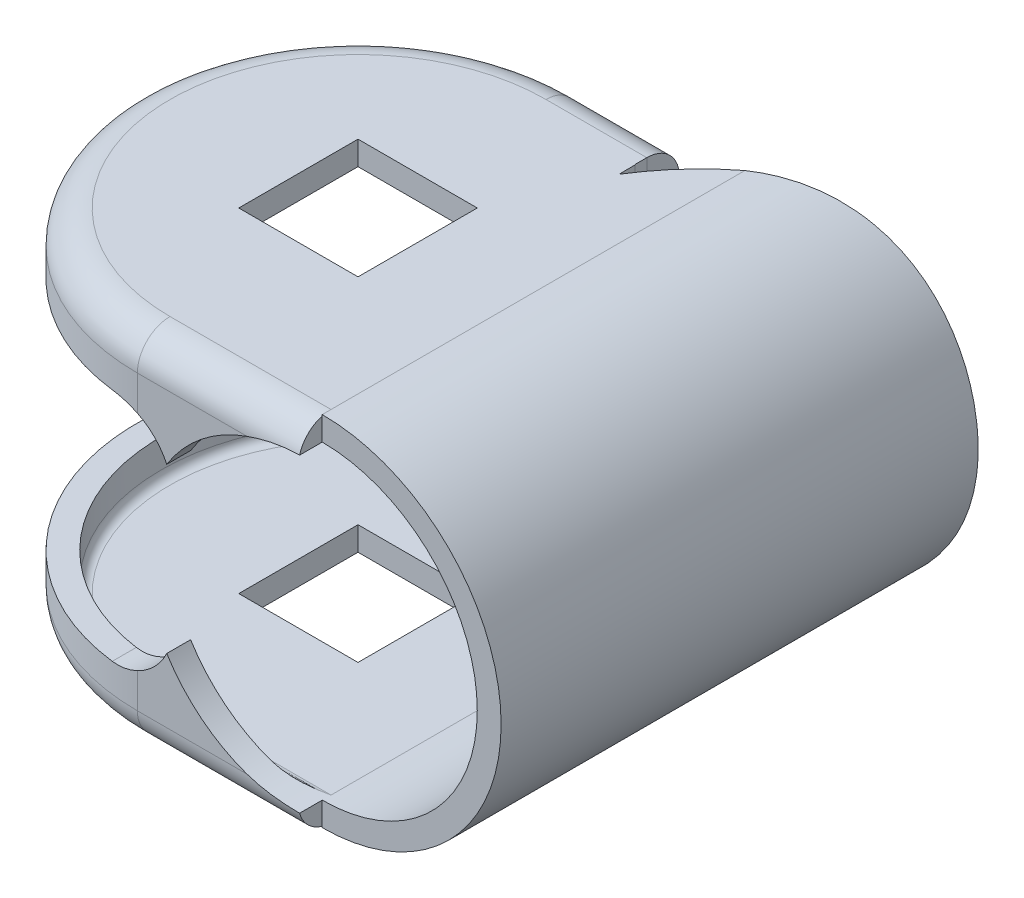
ISO-10303-21;
HEADER;
FILE_DESCRIPTION(('STEP AP214'),'2;1');
FILE_NAME('part.step','',(''),(''),'','','');
FILE_SCHEMA(('AUTOMOTIVE_DESIGN { 1 0 10303 214 1 1 1 1 }'));
ENDSEC;
DATA;
#1=APPLICATION_CONTEXT('core data for automotive mechanical design processes');
#2=APPLICATION_PROTOCOL_DEFINITION('international standard','automotive_design',2000,#1);
#3=PRODUCT_CONTEXT('',#1,'mechanical');
#4=PRODUCT('Part','Part','',(#3));
#5=PRODUCT_RELATED_PRODUCT_CATEGORY('part','',(#4));
#6=PRODUCT_DEFINITION_FORMATION('','',#4);
#7=PRODUCT_DEFINITION_CONTEXT('part definition',#1,'design');
#8=PRODUCT_DEFINITION('design','',#6,#7);
#9=PRODUCT_DEFINITION_SHAPE('','',#8);
#10=(LENGTH_UNIT() NAMED_UNIT(*) SI_UNIT(.MILLI.,.METRE.));
#11=(NAMED_UNIT(*) PLANE_ANGLE_UNIT() SI_UNIT($,.RADIAN.));
#12=(NAMED_UNIT(*) SI_UNIT($,.STERADIAN.) SOLID_ANGLE_UNIT());
#13=UNCERTAINTY_MEASURE_WITH_UNIT(LENGTH_MEASURE(1.E-05),#10,'distance_accuracy_value','');
#14=(GEOMETRIC_REPRESENTATION_CONTEXT(3) GLOBAL_UNCERTAINTY_ASSIGNED_CONTEXT((#13)) GLOBAL_UNIT_ASSIGNED_CONTEXT((#10,
#11,#12)) REPRESENTATION_CONTEXT('',''));
#15=CARTESIAN_POINT('',(0.,0.,0.));
#16=DIRECTION('',(0.,0.,1.));
#17=DIRECTION('',(1.,0.,0.));
#18=AXIS2_PLACEMENT_3D('',#15,#16,#17);
#19=CARTESIAN_POINT('',(99.9999999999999,28.0000000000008,-20.));
#20=DIRECTION('',(0.,1.,0.));
#21=DIRECTION('',(0.,0.,-1.));
#22=AXIS2_PLACEMENT_3D('',#19,#20,#21);
#23=PLANE('',#22);
#24=DIRECTION('',(0.,0.,1.));
#25=VECTOR('',#24,1.);
#26=CARTESIAN_POINT('',(-40.4911485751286,28.,-1.5));
#27=LINE('',#26,#25);
#28=CARTESIAN_POINT('',(-40.4911485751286,28.,-1.5));
#29=VERTEX_POINT('',#28);
#30=CARTESIAN_POINT('',(-40.4911485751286,27.9999999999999,8.5));
#31=VERTEX_POINT('',#30);
#32=EDGE_CURVE('E226',#29,#31,#27,.T.);
#33=ORIENTED_EDGE('',*,*,#32,.F.);
#34=DIRECTION('',(-1.,0.,0.));
#35=VECTOR('',#34,1.);
#36=CARTESIAN_POINT('',(-40.4911485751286,28.,-1.5));
#37=LINE('',#36,#35);
#38=CARTESIAN_POINT('',(-30.4911485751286,28.,-1.5));
#39=VERTEX_POINT('',#38);
#40=EDGE_CURVE('E547',#39,#29,#37,.T.);
#41=ORIENTED_EDGE('',*,*,#40,.F.);
#42=DIRECTION('',(0.,0.,-1.));
#43=VECTOR('',#42,1.);
#44=CARTESIAN_POINT('',(-30.4911485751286,28.,-1.5));
#45=LINE('',#44,#43);
#46=CARTESIAN_POINT('',(-30.4911485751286,28.,8.5));
#47=VERTEX_POINT('',#46);
#48=EDGE_CURVE('E531',#47,#39,#45,.T.);
#49=ORIENTED_EDGE('',*,*,#48,.F.);
#50=DIRECTION('',(1.,0.,0.));
#51=VECTOR('',#50,1.);
#52=CARTESIAN_POINT('',(-40.4911485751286,28.,8.5));
#53=LINE('',#52,#51);
#54=EDGE_CURVE('E540',#31,#47,#53,.T.);
#55=ORIENTED_EDGE('',*,*,#54,.F.);
#56=EDGE_LOOP('',(#33,#41,#49,#55));
#57=FACE_BOUND('',#56,.T.);
#58=CARTESIAN_POINT('',(-35.4911485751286,27.9999999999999,3.5));
#59=DIRECTION('',(0.,1.,0.));
#60=DIRECTION('',(-1.,0.,0.));
#61=AXIS2_PLACEMENT_3D('',#58,#59,#60);
#62=CIRCLE('',#61,15.7634);
#63=CARTESIAN_POINT('',(-35.4911485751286,27.9999999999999,-12.2633999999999));
#64=VERTEX_POINT('',#63);
#65=CARTESIAN_POINT('',(-35.4911485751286,27.9999999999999,19.2634000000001));
#66=VERTEX_POINT('',#65);
#67=EDGE_CURVE('E1575',#64,#66,#62,.T.);
#68=ORIENTED_EDGE('',*,*,#67,.T.);
#69=DIRECTION('',(1.,0.,0.));
#70=VECTOR('',#69,1.);
#71=CARTESIAN_POINT('',(-35.4911485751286,27.9999999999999,19.2634));
#72=LINE('',#71,#70);
#73=CARTESIAN_POINT('',(-21.9911485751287,28.,19.2634));
#74=VERTEX_POINT('',#73);
#75=EDGE_CURVE('E1570',#66,#74,#72,.T.);
#76=ORIENTED_EDGE('',*,*,#75,.T.);
#77=DIRECTION('',(0.,0.,-1.));
#78=VECTOR('',#77,1.);
#79=CARTESIAN_POINT('',(-21.9911485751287,28.,-20.));
#80=LINE('',#79,#78);
#81=CARTESIAN_POINT('',(-21.9911485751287,28.,-15.4454970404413));
#82=VERTEX_POINT('',#81);
#83=EDGE_CURVE('E1455',#74,#82,#80,.T.);
#84=ORIENTED_EDGE('',*,*,#83,.T.);
#85=CARTESIAN_POINT('',(-8.74368744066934,28.0000000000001,1.54337426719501));
#86=DIRECTION('',(0.,1.,0.));
#87=DIRECTION('',(-1.,0.,0.));
#88=AXIS2_PLACEMENT_3D('',#85,#86,#87);
#89=CIRCLE('',#88,21.543374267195);
#90=CARTESIAN_POINT('',(-26.9911485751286,28.,-9.90857477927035));
#91=VERTEX_POINT('',#90);
#92=EDGE_CURVE('E1426',#82,#91,#89,.T.);
#93=ORIENTED_EDGE('',*,*,#92,.T.);
#94=DIRECTION('',(-0.0160371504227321,0.,-0.999871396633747));
#95=VECTOR('',#94,1.);
#96=CARTESIAN_POINT('',(-27.1203045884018,28.,-17.9610903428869));
#97=LINE('',#96,#95);
#98=CARTESIAN_POINT('',(-27.0128789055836,28.,-11.2634));
#99=VERTEX_POINT('',#98);
#100=EDGE_CURVE('E1441',#91,#99,#97,.T.);
#101=ORIENTED_EDGE('',*,*,#100,.T.);
#102=DIRECTION('',(1.,0.,0.));
#103=VECTOR('',#102,1.);
#104=CARTESIAN_POINT('',(99.9999999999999,28.0000000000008,-11.2634));
#105=LINE('',#104,#103);
#106=CARTESIAN_POINT('',(-27.040732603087,28.,-11.2634));
#107=VERTEX_POINT('',#106);
#108=EDGE_CURVE('E1514',#107,#99,#105,.T.);
#109=ORIENTED_EDGE('',*,*,#108,.F.);
#110=DIRECTION('',(0.,0.,1.));
#111=VECTOR('',#110,1.);
#112=CARTESIAN_POINT('',(-27.040732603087,28.,-20.));
#113=LINE('',#112,#111);
#114=CARTESIAN_POINT('',(-27.040732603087,28.,-12.2634));
#115=VERTEX_POINT('',#114);
#116=EDGE_CURVE('E1378',#115,#107,#113,.T.);
#117=ORIENTED_EDGE('',*,*,#116,.F.);
#118=DIRECTION('',(-1.,0.,0.));
#119=VECTOR('',#118,1.);
#120=CARTESIAN_POINT('',(-27.040732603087,28.,-12.2634));
#121=LINE('',#120,#119);
#122=EDGE_CURVE('E1585',#115,#64,#121,.T.);
#123=ORIENTED_EDGE('',*,*,#122,.T.);
#124=EDGE_LOOP('',(#68,#76,#84,#93,#101,#109,#117,#123));
#125=FACE_BOUND('',#124,.T.);
#126=ADVANCED_FACE('F211',(#57,#125),#23,.T.);
#127=CARTESIAN_POINT('',(99.9999999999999,26.0000000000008,-20.));
#128=DIRECTION('',(0.,1.,0.));
#129=DIRECTION('',(0.,0.,-1.));
#130=AXIS2_PLACEMENT_3D('',#127,#128,#129);
#131=PLANE('',#130);
#132=DIRECTION('',(-1.,0.,0.));
#133=VECTOR('',#132,1.);
#134=CARTESIAN_POINT('',(99.9999999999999,26.0000000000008,-1.50000000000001));
#135=LINE('',#134,#133);
#136=CARTESIAN_POINT('',(-30.4911485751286,25.9999999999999,-1.5));
#137=VERTEX_POINT('',#136);
#138=CARTESIAN_POINT('',(-40.4911485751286,25.9999999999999,-1.5));
#139=VERTEX_POINT('',#138);
#140=EDGE_CURVE('E577',#137,#139,#135,.T.);
#141=ORIENTED_EDGE('',*,*,#140,.T.);
#142=DIRECTION('',(0.,0.,1.));
#143=VECTOR('',#142,1.);
#144=CARTESIAN_POINT('',(-40.4911485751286,25.9999999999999,-20.));
#145=LINE('',#144,#143);
#146=CARTESIAN_POINT('',(-40.4911485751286,25.9999999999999,8.5));
#147=VERTEX_POINT('',#146);
#148=EDGE_CURVE('E580',#139,#147,#145,.T.);
#149=ORIENTED_EDGE('',*,*,#148,.T.);
#150=DIRECTION('',(1.,0.,0.));
#151=VECTOR('',#150,1.);
#152=CARTESIAN_POINT('',(99.9999999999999,26.0000000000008,8.5));
#153=LINE('',#152,#151);
#154=CARTESIAN_POINT('',(-30.4911485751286,25.9999999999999,8.5));
#155=VERTEX_POINT('',#154);
#156=EDGE_CURVE('E567',#147,#155,#153,.T.);
#157=ORIENTED_EDGE('',*,*,#156,.T.);
#158=DIRECTION('',(0.,0.,-1.));
#159=VECTOR('',#158,1.);
#160=CARTESIAN_POINT('',(-30.4911485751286,25.9999999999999,-20.));
#161=LINE('',#160,#159);
#162=EDGE_CURVE('E534',#155,#137,#161,.T.);
#163=ORIENTED_EDGE('',*,*,#162,.T.);
#164=EDGE_LOOP('',(#141,#149,#157,#163));
#165=FACE_BOUND('',#164,.T.);
#166=DIRECTION('',(1.,0.,0.));
#167=VECTOR('',#166,1.);
#168=CARTESIAN_POINT('',(-35.4911485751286,25.9999999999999,19.2634));
#169=LINE('',#168,#167);
#170=CARTESIAN_POINT('',(-35.4911485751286,25.9999999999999,19.2634));
#171=VERTEX_POINT('',#170);
#172=CARTESIAN_POINT('',(-21.9911485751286,26.,19.2634));
#173=VERTEX_POINT('',#172);
#174=EDGE_CURVE('E1496',#171,#173,#169,.T.);
#175=ORIENTED_EDGE('',*,*,#174,.F.);
#176=CARTESIAN_POINT('',(-35.4911485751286,25.9999999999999,3.5));
#177=DIRECTION('',(0.,1.,0.));
#178=DIRECTION('',(0.,0.,-1.));
#179=AXIS2_PLACEMENT_3D('',#176,#177,#178);
#180=CIRCLE('',#179,15.7634);
#181=CARTESIAN_POINT('',(-35.4911485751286,25.9999999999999,-12.2634));
#182=VERTEX_POINT('',#181);
#183=EDGE_CURVE('E1500',#182,#171,#180,.T.);
#184=ORIENTED_EDGE('',*,*,#183,.F.);
#185=DIRECTION('',(-1.,0.,0.));
#186=VECTOR('',#185,1.);
#187=CARTESIAN_POINT('',(-27.040732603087,26.,-12.2634));
#188=LINE('',#187,#186);
#189=CARTESIAN_POINT('',(-27.040732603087,26.,-12.2634));
#190=VERTEX_POINT('',#189);
#191=EDGE_CURVE('E1486',#190,#182,#188,.T.);
#192=ORIENTED_EDGE('',*,*,#191,.F.);
#193=DIRECTION('',(0.,0.,1.));
#194=VECTOR('',#193,1.);
#195=CARTESIAN_POINT('',(-27.040732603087,26.,-12.2634));
#196=LINE('',#195,#194);
#197=CARTESIAN_POINT('',(-27.040732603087,26.,-11.2634));
#198=VERTEX_POINT('',#197);
#199=EDGE_CURVE('E1512',#190,#198,#196,.T.);
#200=ORIENTED_EDGE('',*,*,#199,.T.);
#201=DIRECTION('',(1.,0.,0.));
#202=VECTOR('',#201,1.);
#203=CARTESIAN_POINT('',(-27.040732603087,26.,-11.2634));
#204=LINE('',#203,#202);
#205=CARTESIAN_POINT('',(-27.0128789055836,26.,-11.2634));
#206=VERTEX_POINT('',#205);
#207=EDGE_CURVE('E1516',#198,#206,#204,.T.);
#208=ORIENTED_EDGE('',*,*,#207,.T.);
#209=DIRECTION('',(-0.0160371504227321,0.,-0.999871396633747));
#210=VECTOR('',#209,1.);
#211=CARTESIAN_POINT('',(-27.1203045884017,26.,-17.9610903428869));
#212=LINE('',#211,#210);
#213=CARTESIAN_POINT('',(-26.9911485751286,26.,-9.90857477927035));
#214=VERTEX_POINT('',#213);
#215=EDGE_CURVE('E1435',#214,#206,#212,.T.);
#216=ORIENTED_EDGE('',*,*,#215,.F.);
#217=CARTESIAN_POINT('',(-8.74368744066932,26.0000000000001,1.54337426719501));
#218=DIRECTION('',(0.,1.,0.));
#219=DIRECTION('',(-1.,0.,0.));
#220=AXIS2_PLACEMENT_3D('',#217,#218,#219);
#221=CIRCLE('',#220,21.543374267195);
#222=CARTESIAN_POINT('',(-21.9911485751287,26.,-15.4454970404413));
#223=VERTEX_POINT('',#222);
#224=EDGE_CURVE('E1423',#223,#214,#221,.T.);
#225=ORIENTED_EDGE('',*,*,#224,.F.);
#226=DIRECTION('',(0.,0.,-1.));
#227=VECTOR('',#226,1.);
#228=CARTESIAN_POINT('',(-21.9911485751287,26.,-20.));
#229=LINE('',#228,#227);
#230=EDGE_CURVE('E1433',#173,#223,#229,.T.);
#231=ORIENTED_EDGE('',*,*,#230,.F.);
#232=EDGE_LOOP('',(#175,#184,#192,#200,#208,#216,#225,#231));
#233=FACE_BOUND('',#232,.T.);
#234=ADVANCED_FACE('F213',(#165,#233),#131,.F.);
#235=CARTESIAN_POINT('',(-21.9911485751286,0.,19.2634));
#236=DIRECTION('',(1.,0.,0.));
#237=DIRECTION('',(0.,0.,-1.));
#238=AXIS2_PLACEMENT_3D('',#235,#236,#237);
#239=PLANE('',#238);
#240=CARTESIAN_POINT('',(-21.9911485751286,0.7366,19.2634));
#241=DIRECTION('',(1.,0.,0.));
#242=DIRECTION('',(0.,0.,-1.));
#243=AXIS2_PLACEMENT_3D('',#240,#241,#242);
#244=CIRCLE('',#243,2.7366);
#245=CARTESIAN_POINT('',(-21.9911485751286,-2.,19.2634));
#246=VERTEX_POINT('',#245);
#247=CARTESIAN_POINT('',(-21.9911485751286,-1.89900239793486,20.));
#248=VERTEX_POINT('',#247);
#249=EDGE_CURVE('E1355',#246,#248,#244,.F.);
#250=ORIENTED_EDGE('',*,*,#249,.F.);
#251=DIRECTION('',(0.,0.,-1.));
#252=VECTOR('',#251,1.);
#253=CARTESIAN_POINT('',(-21.9911485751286,-2.,-20.));
#254=LINE('',#253,#252);
#255=CARTESIAN_POINT('',(-21.9911485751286,-2.,20.));
#256=VERTEX_POINT('',#255);
#257=EDGE_CURVE('E1460',#256,#246,#254,.T.);
#258=ORIENTED_EDGE('',*,*,#257,.F.);
#259=DIRECTION('',(0.,-1.,0.));
#260=VECTOR('',#259,1.);
#261=CARTESIAN_POINT('',(-21.9911485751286,-2.,20.));
#262=LINE('',#261,#260);
#263=EDGE_CURVE('E1459',#248,#256,#262,.T.);
#264=ORIENTED_EDGE('',*,*,#263,.F.);
#265=EDGE_LOOP('',(#250,#258,#264));
#266=FACE_BOUND('',#265,.T.);
#267=ADVANCED_FACE('F807',(#266),#239,.F.);
#268=CARTESIAN_POINT('',(-100.,-2.,-20.));
#269=DIRECTION('',(0.,-1.,0.));
#270=DIRECTION('',(0.,0.,-1.));
#271=AXIS2_PLACEMENT_3D('',#268,#269,#270);
#272=PLANE('',#271);
#273=DIRECTION('',(0.,0.,1.));
#274=VECTOR('',#273,1.);
#275=CARTESIAN_POINT('',(-40.4911485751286,-2.,-1.5));
#276=LINE('',#275,#274);
#277=CARTESIAN_POINT('',(-40.4911485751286,-2.,-1.5));
#278=VERTEX_POINT('',#277);
#279=CARTESIAN_POINT('',(-40.4911485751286,-2.,8.5));
#280=VERTEX_POINT('',#279);
#281=EDGE_CURVE('E549',#278,#280,#276,.T.);
#282=ORIENTED_EDGE('',*,*,#281,.T.);
#283=DIRECTION('',(1.,0.,0.));
#284=VECTOR('',#283,1.);
#285=CARTESIAN_POINT('',(-40.4911485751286,-2.,8.5));
#286=LINE('',#285,#284);
#287=CARTESIAN_POINT('',(-30.4911485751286,-2.,8.5));
#288=VERTEX_POINT('',#287);
#289=EDGE_CURVE('E555',#280,#288,#286,.T.);
#290=ORIENTED_EDGE('',*,*,#289,.T.);
#291=DIRECTION('',(0.,0.,-1.));
#292=VECTOR('',#291,1.);
#293=CARTESIAN_POINT('',(-30.4911485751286,-2.,-1.5));
#294=LINE('',#293,#292);
#295=CARTESIAN_POINT('',(-30.4911485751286,-2.,-1.5));
#296=VERTEX_POINT('',#295);
#297=EDGE_CURVE('E558',#288,#296,#294,.T.);
#298=ORIENTED_EDGE('',*,*,#297,.T.);
#299=DIRECTION('',(-1.,0.,0.));
#300=VECTOR('',#299,1.);
#301=CARTESIAN_POINT('',(-40.4911485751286,-2.,-1.5));
#302=LINE('',#301,#300);
#303=EDGE_CURVE('E561',#296,#278,#302,.T.);
#304=ORIENTED_EDGE('',*,*,#303,.T.);
#305=EDGE_LOOP('',(#282,#290,#298,#304));
#306=FACE_BOUND('',#305,.T.);
#307=DIRECTION('',(-1.,0.,0.));
#308=VECTOR('',#307,1.);
#309=CARTESIAN_POINT('',(-100.,-2.,-11.2634));
#310=LINE('',#309,#308);
#311=CARTESIAN_POINT('',(-27.0128789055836,-2.,-11.2634));
#312=VERTEX_POINT('',#311);
#313=CARTESIAN_POINT('',(-27.040732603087,-2.,-11.2634));
#314=VERTEX_POINT('',#313);
#315=EDGE_CURVE('E1397',#312,#314,#310,.T.);
#316=ORIENTED_EDGE('',*,*,#315,.F.);
#317=DIRECTION('',(0.0160371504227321,0.,0.999871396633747));
#318=VECTOR('',#317,1.);
#319=CARTESIAN_POINT('',(-27.1717426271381,-2.,-21.1681079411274));
#320=LINE('',#319,#318);
#321=CARTESIAN_POINT('',(-26.9911485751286,-2.,-9.90857477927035));
#322=VERTEX_POINT('',#321);
#323=EDGE_CURVE('E1649',#312,#322,#320,.T.);
#324=ORIENTED_EDGE('',*,*,#323,.T.);
#325=CARTESIAN_POINT('',(-8.74368744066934,-2.,1.54337426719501));
#326=DIRECTION('',(0.,-1.,0.));
#327=DIRECTION('',(0.,0.,-1.));
#328=AXIS2_PLACEMENT_3D('',#325,#326,#327);
#329=CIRCLE('',#328,21.543374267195);
#330=CARTESIAN_POINT('',(-21.9911485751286,-2.,-15.4454970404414));
#331=VERTEX_POINT('',#330);
#332=EDGE_CURVE('E859',#322,#331,#329,.T.);
#333=ORIENTED_EDGE('',*,*,#332,.T.);
#334=EDGE_CURVE('E1450',#246,#331,#254,.T.);
#335=ORIENTED_EDGE('',*,*,#334,.F.);
#336=DIRECTION('',(1.,0.,0.));
#337=VECTOR('',#336,1.);
#338=CARTESIAN_POINT('',(-35.4911485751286,-2.,19.2634));
#339=LINE('',#338,#337);
#340=CARTESIAN_POINT('',(-35.4911485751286,-2.,19.2634));
#341=VERTEX_POINT('',#340);
#342=EDGE_CURVE('E1359',#341,#246,#339,.T.);
#343=ORIENTED_EDGE('',*,*,#342,.F.);
#344=CARTESIAN_POINT('',(-35.4911485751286,-2.,3.5));
#345=DIRECTION('',(0.,1.,0.));
#346=DIRECTION('',(0.,0.,1.));
#347=AXIS2_PLACEMENT_3D('',#344,#345,#346);
#348=CIRCLE('',#347,15.7634);
#349=CARTESIAN_POINT('',(-35.4911485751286,-2.,-12.2634));
#350=VERTEX_POINT('',#349);
#351=EDGE_CURVE('E1364',#350,#341,#348,.T.);
#352=ORIENTED_EDGE('',*,*,#351,.F.);
#353=DIRECTION('',(-1.,0.,0.));
#354=VECTOR('',#353,1.);
#355=CARTESIAN_POINT('',(-27.040732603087,-2.,-12.2634));
#356=LINE('',#355,#354);
#357=CARTESIAN_POINT('',(-27.040732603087,-2.,-12.2634));
#358=VERTEX_POINT('',#357);
#359=EDGE_CURVE('E1371',#358,#350,#356,.T.);
#360=ORIENTED_EDGE('',*,*,#359,.F.);
#361=DIRECTION('',(0.,0.,-1.));
#362=VECTOR('',#361,1.);
#363=CARTESIAN_POINT('',(-27.040732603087,-2.,-20.));
#364=LINE('',#363,#362);
#365=EDGE_CURVE('E861',#314,#358,#364,.T.);
#366=ORIENTED_EDGE('',*,*,#365,.F.);
#367=EDGE_LOOP('',(#316,#324,#333,#335,#343,#352,#360,#366));
#368=FACE_BOUND('',#367,.T.);
#369=ADVANCED_FACE('F814',(#306,#368),#272,.T.);
#370=CARTESIAN_POINT('',(-100.,0.,-20.));
#371=DIRECTION('',(0.,-1.,0.));
#372=DIRECTION('',(0.,0.,-1.));
#373=AXIS2_PLACEMENT_3D('',#370,#371,#372);
#374=PLANE('',#373);
#375=DIRECTION('',(-1.,0.,0.));
#376=VECTOR('',#375,1.);
#377=CARTESIAN_POINT('',(-100.,0.,8.5));
#378=LINE('',#377,#376);
#379=CARTESIAN_POINT('',(-30.4911485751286,0.,8.5));
#380=VERTEX_POINT('',#379);
#381=CARTESIAN_POINT('',(-40.4911485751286,0.,8.5));
#382=VERTEX_POINT('',#381);
#383=EDGE_CURVE('E925',#380,#382,#378,.T.);
#384=ORIENTED_EDGE('',*,*,#383,.T.);
#385=DIRECTION('',(0.,0.,-1.));
#386=VECTOR('',#385,1.);
#387=CARTESIAN_POINT('',(-40.4911485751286,0.,-20.));
#388=LINE('',#387,#386);
#389=CARTESIAN_POINT('',(-40.4911485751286,0.,-1.5));
#390=VERTEX_POINT('',#389);
#391=EDGE_CURVE('E12',#382,#390,#388,.T.);
#392=ORIENTED_EDGE('',*,*,#391,.T.);
#393=DIRECTION('',(1.,0.,0.));
#394=VECTOR('',#393,1.);
#395=CARTESIAN_POINT('',(-100.,0.,-1.49999999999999));
#396=LINE('',#395,#394);
#397=CARTESIAN_POINT('',(-30.4911485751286,0.,-1.5));
#398=VERTEX_POINT('',#397);
#399=EDGE_CURVE('E219',#390,#398,#396,.T.);
#400=ORIENTED_EDGE('',*,*,#399,.T.);
#401=DIRECTION('',(0.,0.,1.));
#402=VECTOR('',#401,1.);
#403=CARTESIAN_POINT('',(-30.4911485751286,0.,-20.));
#404=LINE('',#403,#402);
#405=EDGE_CURVE('E934',#398,#380,#404,.T.);
#406=ORIENTED_EDGE('',*,*,#405,.T.);
#407=EDGE_LOOP('',(#384,#392,#400,#406));
#408=FACE_BOUND('',#407,.T.);
#409=DIRECTION('',(0.0160371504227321,0.,0.999871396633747));
#410=VECTOR('',#409,1.);
#411=CARTESIAN_POINT('',(-27.1717426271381,0.,-21.1681079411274));
#412=LINE('',#411,#410);
#413=CARTESIAN_POINT('',(-27.0128789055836,0.,-11.2634));
#414=VERTEX_POINT('',#413);
#415=CARTESIAN_POINT('',(-26.9911485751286,0.,-9.90857477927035));
#416=VERTEX_POINT('',#415);
#417=EDGE_CURVE('E1647',#414,#416,#412,.T.);
#418=ORIENTED_EDGE('',*,*,#417,.F.);
#419=DIRECTION('',(-1.,0.,0.));
#420=VECTOR('',#419,1.);
#421=CARTESIAN_POINT('',(-27.0128789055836,0.,-11.2634));
#422=LINE('',#421,#420);
#423=CARTESIAN_POINT('',(-27.040732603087,0.,-11.2634));
#424=VERTEX_POINT('',#423);
#425=EDGE_CURVE('E1395',#414,#424,#422,.T.);
#426=ORIENTED_EDGE('',*,*,#425,.T.);
#427=DIRECTION('',(0.,0.,-1.));
#428=VECTOR('',#427,1.);
#429=CARTESIAN_POINT('',(-27.040732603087,0.,-11.2634));
#430=LINE('',#429,#428);
#431=CARTESIAN_POINT('',(-27.040732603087,0.,-12.2634));
#432=VERTEX_POINT('',#431);
#433=EDGE_CURVE('E1399',#424,#432,#430,.T.);
#434=ORIENTED_EDGE('',*,*,#433,.T.);
#435=DIRECTION('',(-1.,0.,0.));
#436=VECTOR('',#435,1.);
#437=CARTESIAN_POINT('',(-27.040732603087,0.,-12.2634));
#438=LINE('',#437,#436);
#439=CARTESIAN_POINT('',(-35.4911485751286,0.,-12.2634));
#440=VERTEX_POINT('',#439);
#441=EDGE_CURVE('E1528',#432,#440,#438,.T.);
#442=ORIENTED_EDGE('',*,*,#441,.T.);
#443=CARTESIAN_POINT('',(-35.4911485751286,0.,3.5));
#444=DIRECTION('',(0.,1.,0.));
#445=DIRECTION('',(0.,0.,-1.));
#446=AXIS2_PLACEMENT_3D('',#443,#444,#445);
#447=CIRCLE('',#446,15.7634);
#448=CARTESIAN_POINT('',(-35.4911485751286,0.,19.2634));
#449=VERTEX_POINT('',#448);
#450=EDGE_CURVE('E1336',#440,#449,#447,.T.);
#451=ORIENTED_EDGE('',*,*,#450,.T.);
#452=DIRECTION('',(1.,0.,0.));
#453=VECTOR('',#452,1.);
#454=CARTESIAN_POINT('',(-35.4911485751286,0.,19.2634));
#455=LINE('',#454,#453);
#456=CARTESIAN_POINT('',(-21.9911485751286,0.,19.2634));
#457=VERTEX_POINT('',#456);
#458=EDGE_CURVE('E1350',#449,#457,#455,.T.);
#459=ORIENTED_EDGE('',*,*,#458,.T.);
#460=DIRECTION('',(0.,0.,-1.));
#461=VECTOR('',#460,1.);
#462=CARTESIAN_POINT('',(-21.9911485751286,0.,-20.));
#463=LINE('',#462,#461);
#464=CARTESIAN_POINT('',(-21.9911485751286,0.,-15.4454970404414));
#465=VERTEX_POINT('',#464);
#466=EDGE_CURVE('E1453',#457,#465,#463,.T.);
#467=ORIENTED_EDGE('',*,*,#466,.T.);
#468=CARTESIAN_POINT('',(-8.74368744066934,0.,1.54337426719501));
#469=DIRECTION('',(0.,-1.,0.));
#470=DIRECTION('',(0.,0.,-1.));
#471=AXIS2_PLACEMENT_3D('',#468,#469,#470);
#472=CIRCLE('',#471,21.543374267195);
#473=EDGE_CURVE('E1645',#416,#465,#472,.T.);
#474=ORIENTED_EDGE('',*,*,#473,.F.);
#475=EDGE_LOOP('',(#418,#426,#434,#442,#451,#459,#467,#474));
#476=FACE_BOUND('',#475,.T.);
#477=ADVANCED_FACE('F810',(#408,#476),#374,.F.);
#478=CARTESIAN_POINT('',(-21.9911485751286,13.,-59.4848086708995));
#479=DIRECTION('',(0.,0.,1.));
#480=DIRECTION('',(1.,0.,0.));
#481=AXIS2_PLACEMENT_3D('',#478,#479,#480);
#482=CYLINDRICAL_SURFACE('',#481,15.);
#483=ORIENTED_EDGE('',*,*,#257,.T.);
#484=ORIENTED_EDGE('',*,*,#334,.T.);
#485=CARTESIAN_POINT('',(-21.9911485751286,-2.,-15.4454970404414));
#486=CARTESIAN_POINT('',(-21.8046680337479,-2.00000372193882,-15.5715294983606));
#487=CARTESIAN_POINT('',(-21.6164550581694,-1.99652251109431,-15.6950180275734));
#488=CARTESIAN_POINT('',(-21.2368953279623,-1.98222795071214,-15.9367964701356));
#489=CARTESIAN_POINT('',(-21.0455474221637,-1.97141184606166,-16.0550844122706));
#490=CARTESIAN_POINT('',(-20.6601702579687,-1.94208320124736,-16.2862676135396));
#491=CARTESIAN_POINT('',(-20.4661407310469,-1.92356988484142,-16.3991623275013));
#492=CARTESIAN_POINT('',(-20.0756311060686,-1.87849020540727,-16.6195545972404));
#493=CARTESIAN_POINT('',(-19.8791482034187,-1.85191362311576,-16.7270451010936));
#494=CARTESIAN_POINT('',(-19.4845036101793,-1.79042291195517,-16.9363639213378));
#495=CARTESIAN_POINT('',(-19.2863421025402,-1.75550968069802,-17.0381928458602));
#496=CARTESIAN_POINT('',(-18.8888469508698,-1.67708272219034,-17.2360891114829));
#497=CARTESIAN_POINT('',(-18.6895133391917,-1.63356923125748,-17.3321566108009));
#498=CARTESIAN_POINT('',(-18.3398307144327,-1.54962868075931,-17.4953310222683));
#499=CARTESIAN_POINT('',(-18.1896100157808,-1.51111862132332,-17.5637053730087));
#500=CARTESIAN_POINT('',(-17.8890691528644,-1.42904072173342,-17.6971230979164));
#501=CARTESIAN_POINT('',(-17.7387489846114,-1.38547266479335,-17.7621663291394));
#502=CARTESIAN_POINT('',(-17.2880630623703,-1.24709486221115,-17.9523418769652));
#503=CARTESIAN_POINT('',(-16.987921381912,-1.14459944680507,-18.0725435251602));
#504=CARTESIAN_POINT('',(-16.3906432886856,-0.918915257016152,-18.2996014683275));
#505=CARTESIAN_POINT('',(-16.0935051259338,-0.795739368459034,-18.4064660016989));
#506=CARTESIAN_POINT('',(-15.5041944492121,-0.528640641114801,-18.6072169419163));
#507=CARTESIAN_POINT('',(-15.2120223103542,-0.384716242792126,-18.7011023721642));
#508=CARTESIAN_POINT('',(-14.5884030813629,-0.0515702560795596,-18.8904071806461));
#509=CARTESIAN_POINT('',(-14.2581820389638,0.141213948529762,-18.9836525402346));
#510=CARTESIAN_POINT('',(-13.7725708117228,0.45042308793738,-19.1115355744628));
#511=CARTESIAN_POINT('',(-13.6122938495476,0.556851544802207,-19.1521716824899));
#512=CARTESIAN_POINT('',(-13.2953421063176,0.776248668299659,-19.2296611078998));
#513=CARTESIAN_POINT('',(-13.1386672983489,0.889217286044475,-19.2665144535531));
#514=CARTESIAN_POINT('',(-12.6743587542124,1.23788998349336,-19.3715963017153));
#515=CARTESIAN_POINT('',(-12.3726292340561,1.48324119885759,-19.4342975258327));
#516=CARTESIAN_POINT('',(-11.7878739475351,1.99795590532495,-19.5465190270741));
#517=CARTESIAN_POINT('',(-11.5048477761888,2.26731887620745,-19.5960395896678));
#518=CARTESIAN_POINT('',(-10.961643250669,2.82645971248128,-19.6832269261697));
#519=CARTESIAN_POINT('',(-10.7013268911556,3.11609168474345,-19.7209695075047));
#520=CARTESIAN_POINT('',(-10.2035442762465,3.71538176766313,-19.7867343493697));
#521=CARTESIAN_POINT('',(-9.96607798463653,4.0250398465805,-19.8147566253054));
#522=CARTESIAN_POINT('',(-9.51575796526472,4.66232312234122,-19.8628235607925));
#523=CARTESIAN_POINT('',(-9.30290333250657,4.98994765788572,-19.8828685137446));
#524=CARTESIAN_POINT('',(-8.90327618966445,5.66105367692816,-19.9164548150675));
#525=CARTESIAN_POINT('',(-8.7165044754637,6.00453564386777,-19.9299959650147));
#526=CARTESIAN_POINT('',(-8.36239990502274,6.72113673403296,-19.9526957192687));
#527=CARTESIAN_POINT('',(-8.19634102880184,7.09489312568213,-19.9616264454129));
#528=CARTESIAN_POINT('',(-7.89527180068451,7.85477981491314,-19.9757026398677));
#529=CARTESIAN_POINT('',(-7.76026228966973,8.24091044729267,-19.9808480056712));
#530=CARTESIAN_POINT('',(-7.52220067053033,9.02298530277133,-19.9886241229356));
#531=CARTESIAN_POINT('',(-7.41915313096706,9.41893092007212,-19.9912545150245));
#532=CARTESIAN_POINT('',(-7.24573699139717,10.2179216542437,-19.9950455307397));
#533=CARTESIAN_POINT('',(-7.1753687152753,10.6209668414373,-19.9962061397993));
#534=CARTESIAN_POINT('',(-7.06628080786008,11.4427902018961,-19.9977913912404));
#535=CARTESIAN_POINT('',(-7.02850015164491,11.8616933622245,-19.998194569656));
#536=CARTESIAN_POINT('',(-6.98823809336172,12.7011986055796,-19.998621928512));
#537=CARTESIAN_POINT('',(-6.98575742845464,13.1218007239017,-19.9986461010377));
#538=CARTESIAN_POINT('',(-7.01611428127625,13.961753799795,-19.99838531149));
#539=CARTESIAN_POINT('',(-7.04895392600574,14.381104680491,-19.9981003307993));
#540=CARTESIAN_POINT('',(-7.14972470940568,15.2155699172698,-19.9966979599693));
#541=CARTESIAN_POINT('',(-7.21765576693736,15.630684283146,-19.9955805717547));
#542=CARTESIAN_POINT('',(-7.38841113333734,16.4551269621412,-19.9919740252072));
#543=CARTESIAN_POINT('',(-7.49135330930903,16.8644308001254,-19.9894802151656));
#544=CARTESIAN_POINT('',(-7.73136813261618,17.6729461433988,-19.9819140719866));
#545=CARTESIAN_POINT('',(-7.86844102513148,18.072157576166,-19.9768417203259));
#546=CARTESIAN_POINT('',(-8.09884263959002,18.6611246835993,-19.966236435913));
#547=CARTESIAN_POINT('',(-8.1797891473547,18.8558336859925,-19.9622010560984));
#548=CARTESIAN_POINT('',(-8.34980296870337,19.2416448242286,-19.9529581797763));
#549=CARTESIAN_POINT('',(-8.43887028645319,19.4327469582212,-19.9477506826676));
#550=CARTESIAN_POINT('',(-8.71800856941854,20.0000948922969,-19.9299891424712));
#551=CARTESIAN_POINT('',(-8.92005205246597,20.370474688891,-19.9152946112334));
#552=CARTESIAN_POINT('',(-9.35324381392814,21.0906784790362,-19.8783549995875));
#553=CARTESIAN_POINT('',(-9.58423259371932,21.4406007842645,-19.8561502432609));
#554=CARTESIAN_POINT('',(-10.0743164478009,22.1194469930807,-19.802305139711));
#555=CARTESIAN_POINT('',(-10.3334115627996,22.4483708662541,-19.7706647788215));
#556=CARTESIAN_POINT('',(-10.8773694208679,23.0825802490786,-19.6957903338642));
#557=CARTESIAN_POINT('',(-11.1622246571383,23.3878725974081,-19.6525596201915));
#558=CARTESIAN_POINT('',(-11.7551935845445,23.9726254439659,-19.5524437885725));
#559=CARTESIAN_POINT('',(-12.0633062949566,24.2520870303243,-19.495559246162));
#560=CARTESIAN_POINT('',(-12.5348945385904,24.6455689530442,-19.399711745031));
#561=CARTESIAN_POINT('',(-12.6907072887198,24.7703649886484,-19.3667079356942));
#562=CARTESIAN_POINT('',(-13.0066364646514,25.0132528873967,-19.2968589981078));
#563=CARTESIAN_POINT('',(-13.1667528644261,25.1313447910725,-19.2600138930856));
#564=CARTESIAN_POINT('',(-13.6529692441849,25.4752656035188,-19.1434988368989));
#565=CARTESIAN_POINT('',(-13.9850155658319,25.6908055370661,-19.0578333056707));
#566=CARTESIAN_POINT('',(-14.661241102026,26.0930239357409,-18.8692066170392));
#567=CARTESIAN_POINT('',(-15.0054170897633,26.2797100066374,-18.7662500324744));
#568=CARTESIAN_POINT('',(-15.7024757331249,26.6236390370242,-18.5420535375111));
#569=CARTESIAN_POINT('',(-16.0553579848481,26.7808833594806,-18.4208144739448));
#570=CARTESIAN_POINT('',(-16.5812712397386,26.9916793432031,-18.2275207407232));
#571=CARTESIAN_POINT('',(-16.7524702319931,27.0566530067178,-18.1626466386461));
#572=CARTESIAN_POINT('',(-17.0956067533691,27.1798053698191,-18.0285145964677));
#573=CARTESIAN_POINT('',(-17.2675442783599,27.2379841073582,-17.9592566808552));
#574=CARTESIAN_POINT('',(-17.6117825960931,27.3476054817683,-17.8164235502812));
#575=CARTESIAN_POINT('',(-17.7840834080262,27.3990477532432,-17.7428481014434));
#576=CARTESIAN_POINT('',(-18.1286093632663,27.4952680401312,-17.5913219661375));
#577=CARTESIAN_POINT('',(-18.3008345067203,27.540046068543,-17.5133712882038));
#578=CARTESIAN_POINT('',(-18.8167406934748,27.664521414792,-17.2730780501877));
#579=CARTESIAN_POINT('',(-19.1598216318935,27.7344134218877,-17.1042243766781));
#580=CARTESIAN_POINT('',(-19.8412312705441,27.8491496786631,-16.7496703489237));
#581=CARTESIAN_POINT('',(-20.1795614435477,27.8940018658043,-16.5639753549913));
#582=CARTESIAN_POINT('',(-20.7653670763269,27.9519603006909,-16.2247922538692));
#583=CARTESIAN_POINT('',(-21.0144140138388,27.9701993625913,-16.0748557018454));
#584=CARTESIAN_POINT('',(-21.5069784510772,27.9942088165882,-15.7665161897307));
#585=CARTESIAN_POINT('',(-21.7505080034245,28.0000096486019,-15.6081348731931));
#586=CARTESIAN_POINT('',(-21.9911485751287,28.,-15.4454970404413));
#587=B_SPLINE_CURVE_WITH_KNOTS('',3,(#485,#486,#487,#488,#489,#490,#491,#492,#493,#494,#495,
#496,#497,#498,#499,#500,#501,#502,#503,#504,#505,#506,#507,#508,#509,#510,#511,#512,#513,#514,
#515,#516,#517,#518,#519,#520,#521,#522,#523,#524,#525,#526,#527,#528,#529,#530,#531,#532,#533,
#534,#535,#536,#537,#538,#539,#540,#541,#542,#543,#544,#545,#546,#547,#548,#549,#550,#551,#552,
#553,#554,#555,#556,#557,#558,#559,#560,#561,#562,#563,#564,#565,#566,#567,#568,#569,#570,#571,
#572,#573,#574,#575,#576,#577,#578,#579,#580,#581,#582,#583,#584,#585,#586),.UNSPECIFIED.,.F.,
.F.,(4,2,2,2,2,2,2,2,2,2,2,2,2,2,2,2,2,2,2,2,2,2,2,2,2,2,2,2,2,2,2,2,2,2,2,2,2,2,2,2,2,2,2,2,2,
2,2,2,2,2,4),(0.,0.675196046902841,1.35064584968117,2.02616378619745,2.70254146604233,
3.37884635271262,4.05513265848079,4.56347412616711,5.07183738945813,6.08839335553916,
7.10431824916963,8.12031954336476,9.29944960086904,9.88921661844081,10.4789792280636,
11.659187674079,12.8393705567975,14.0117927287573,15.1842130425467,16.3565902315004,
17.5290031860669,18.7548525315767,19.9807350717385,21.2067927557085,22.4328625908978,
23.6931812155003,24.9535261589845,26.21394700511,27.474364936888,28.7390688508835,
30.0037818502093,30.6363270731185,31.2688726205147,32.5336667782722,33.7917750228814,
35.0498850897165,36.3076297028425,37.565321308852,38.172171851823,38.779018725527,
39.9924008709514,41.2054626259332,42.4184682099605,43.0011305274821,43.5837895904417,
44.1664802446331,44.7491697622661,45.9139785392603,47.0784178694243,47.951798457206,
48.8230391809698),.UNSPECIFIED.);
#588=EDGE_CURVE('E852',#331,#82,#587,.T.);
#589=ORIENTED_EDGE('',*,*,#588,.T.);
#590=ORIENTED_EDGE('',*,*,#83,.F.);
#591=CARTESIAN_POINT('',(-21.9911485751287,28.,20.));
#592=VERTEX_POINT('',#591);
#593=EDGE_CURVE('E1463',#592,#74,#80,.T.);
#594=ORIENTED_EDGE('',*,*,#593,.F.);
#595=CARTESIAN_POINT('',(-21.9911485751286,13.,20.));
#596=DIRECTION('',(0.,0.,-1.));
#597=DIRECTION('',(1.,0.,0.));
#598=AXIS2_PLACEMENT_3D('',#595,#596,#597);
#599=CIRCLE('',#598,15.);
#600=EDGE_CURVE('E1447',#592,#256,#599,.T.);
#601=ORIENTED_EDGE('',*,*,#600,.T.);
#602=EDGE_LOOP('',(#483,#484,#589,#590,#594,#601));
#603=FACE_BOUND('',#602,.T.);
#604=ADVANCED_FACE('F813',(#603),#482,.T.);
#605=CARTESIAN_POINT('',(-21.9911485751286,13.,-59.4848086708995));
#606=DIRECTION('',(0.,0.,1.));
#607=DIRECTION('',(1.,0.,0.));
#608=AXIS2_PLACEMENT_3D('',#605,#606,#607);
#609=CYLINDRICAL_SURFACE('',#608,13.);
#610=CARTESIAN_POINT('',(-21.9911485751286,0.,-15.4454970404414));
#611=CARTESIAN_POINT('',(-21.8115057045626,-3.05018972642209E-06,-15.585590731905));
#612=CARTESIAN_POINT('',(-21.6296181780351,0.00372379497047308,-15.7228392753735));
#613=CARTESIAN_POINT('',(-21.2616711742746,0.0191766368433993,-15.99144689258));
#614=CARTESIAN_POINT('',(-21.0756086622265,0.0309086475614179,-16.1228014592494));
#615=CARTESIAN_POINT('',(-20.699861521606,0.0629161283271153,-16.3792370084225));
#616=CARTESIAN_POINT('',(-20.5101761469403,0.0831933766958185,-16.5043166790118));
#617=CARTESIAN_POINT('',(-20.1272363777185,0.132863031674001,-16.7482600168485));
#618=CARTESIAN_POINT('',(-19.9339732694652,0.162281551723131,-16.86710472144));
#619=CARTESIAN_POINT('',(-19.545095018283,0.230670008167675,-17.0979123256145));
#620=CARTESIAN_POINT('',(-19.349480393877,0.269637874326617,-17.2098767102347));
#621=CARTESIAN_POINT('',(-18.9565733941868,0.357536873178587,-17.4267211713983));
#622=CARTESIAN_POINT('',(-18.7592811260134,0.406467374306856,-17.5316016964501));
#623=CARTESIAN_POINT('',(-18.4125454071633,0.501301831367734,-17.7090946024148));
#624=CARTESIAN_POINT('',(-18.2632976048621,0.544977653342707,-17.7832873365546));
#625=CARTESIAN_POINT('',(-17.9646627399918,0.63828886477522,-17.9275338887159));
#626=CARTESIAN_POINT('',(-17.8152756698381,0.687924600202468,-17.9975874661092));
#627=CARTESIAN_POINT('',(-17.3674259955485,0.845934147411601,-18.2014026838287));
#628=CARTESIAN_POINT('',(-17.0692187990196,0.963425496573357,-18.328847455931));
#629=CARTESIAN_POINT('',(-16.4774091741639,1.22277999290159,-18.5665543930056));
#630=CARTESIAN_POINT('',(-16.1837990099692,1.36459595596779,-18.6768490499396));
#631=CARTESIAN_POINT('',(-15.6036937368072,1.67267891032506,-18.880940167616));
#632=CARTESIAN_POINT('',(-15.3171983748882,1.8389450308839,-18.974737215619));
#633=CARTESIAN_POINT('',(-14.8988205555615,2.1038878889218,-19.102464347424));
#634=CARTESIAN_POINT('',(-14.7629647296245,2.19352155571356,-19.1424357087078));
#635=CARTESIAN_POINT('',(-14.4940415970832,2.37832383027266,-19.21880487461));
#636=CARTESIAN_POINT('',(-14.3609742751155,2.4734924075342,-19.2552026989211));
#637=CARTESIAN_POINT('',(-13.966456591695,2.76712563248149,-19.3591283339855));
#638=CARTESIAN_POINT('',(-13.7096262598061,2.97375837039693,-19.4214077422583));
#639=CARTESIAN_POINT('',(-13.210727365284,3.40762589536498,-19.5333422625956));
#640=CARTESIAN_POINT('',(-12.9686720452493,3.63487872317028,-19.5829861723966));
#641=CARTESIAN_POINT('',(-12.5016970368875,4.10838226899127,-19.6710303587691));
#642=CARTESIAN_POINT('',(-12.2767776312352,4.35463330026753,-19.7094304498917));
#643=CARTESIAN_POINT('',(-11.8458709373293,4.8645932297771,-19.7765795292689));
#644=CARTESIAN_POINT('',(-11.6398927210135,5.12831039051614,-19.8053239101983));
#645=CARTESIAN_POINT('',(-11.2485834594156,5.67133708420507,-19.8548077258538));
#646=CARTESIAN_POINT('',(-11.0632522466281,5.95064649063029,-19.8755472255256));
#647=CARTESIAN_POINT('',(-10.7145749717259,6.52302677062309,-19.9104770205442));
#648=CARTESIAN_POINT('',(-10.5512276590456,6.81609686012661,-19.9246676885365));
#649=CARTESIAN_POINT('',(-10.2476067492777,7.41415143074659,-19.9480261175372));
#650=CARTESIAN_POINT('',(-10.1073341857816,7.71913644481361,-19.9571936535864));
#651=CARTESIAN_POINT('',(-9.84337628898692,8.35699261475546,-19.9723302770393));
#652=CARTESIAN_POINT('',(-9.72111256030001,8.69045797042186,-19.9780846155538));
#653=CARTESIAN_POINT('',(-9.50426532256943,9.36630916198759,-19.9868479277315));
#654=CARTESIAN_POINT('',(-9.40968272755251,9.70869529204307,-19.9898568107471));
#655=CARTESIAN_POINT('',(-9.24883136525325,10.4001238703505,-19.9942309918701));
#656=CARTESIAN_POINT('',(-9.18256714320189,10.7491673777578,-19.995596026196));
#657=CARTESIAN_POINT('',(-9.07882157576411,11.4515077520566,-19.9974637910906));
#658=CARTESIAN_POINT('',(-9.04134045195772,11.8048046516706,-19.997966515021));
#659=CARTESIAN_POINT('',(-8.99479053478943,12.522905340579,-19.9985495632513));
#660=CARTESIAN_POINT('',(-8.98652053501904,12.8877611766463,-19.9986180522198));
#661=CARTESIAN_POINT('',(-9.00067448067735,13.6168822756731,-19.9985080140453));
#662=CARTESIAN_POINT('',(-9.02309908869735,13.9811475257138,-19.9983294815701));
#663=CARTESIAN_POINT('',(-9.09848757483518,14.7065379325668,-19.9972181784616));
#664=CARTESIAN_POINT('',(-9.15145427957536,15.0676627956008,-19.9962853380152));
#665=CARTESIAN_POINT('',(-9.28755318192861,15.7841772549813,-19.9932252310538));
#666=CARTESIAN_POINT('',(-9.37068531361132,16.1395668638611,-19.9910979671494));
#667=CARTESIAN_POINT('',(-9.56673163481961,16.8428378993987,-19.9845087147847));
#668=CARTESIAN_POINT('',(-9.6797093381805,17.1907015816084,-19.980041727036));
#669=CARTESIAN_POINT('',(-9.93454063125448,17.8756249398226,-19.9674388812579));
#670=CARTESIAN_POINT('',(-10.076394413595,18.2126845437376,-19.9593029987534));
#671=CARTESIAN_POINT('',(-10.3879210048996,18.8735472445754,-19.9377847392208));
#672=CARTESIAN_POINT('',(-10.5575951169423,19.1973497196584,-19.9244021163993));
#673=CARTESIAN_POINT('',(-10.9234161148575,19.8292435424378,-19.8903365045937));
#674=CARTESIAN_POINT('',(-11.1195625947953,20.1373351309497,-19.869653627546));
#675=CARTESIAN_POINT('',(-11.5341269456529,20.7317777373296,-19.8194962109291));
#676=CARTESIAN_POINT('',(-11.7522422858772,21.0183489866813,-19.790132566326));
#677=CARTESIAN_POINT('',(-12.2107717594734,21.5716571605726,-19.7204408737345));
#678=CARTESIAN_POINT('',(-12.4511857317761,21.838394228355,-19.6801129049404));
#679=CARTESIAN_POINT('',(-12.9518443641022,22.3498117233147,-19.5865445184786));
#680=CARTESIAN_POINT('',(-13.2120780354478,22.594504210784,-19.5333112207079));
#681=CARTESIAN_POINT('',(-13.7498300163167,23.0601734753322,-19.412094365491));
#682=CARTESIAN_POINT('',(-14.0273473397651,23.2811516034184,-19.344111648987));
#683=CARTESIAN_POINT('',(-14.4466014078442,23.5880949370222,-19.2319013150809));
#684=CARTESIAN_POINT('',(-14.5829279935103,23.6839074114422,-19.1940024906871));
#685=CARTESIAN_POINT('',(-14.8583986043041,23.8697506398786,-19.1144578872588));
#686=CARTESIAN_POINT('',(-14.9975425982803,23.9597814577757,-19.0728121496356));
#687=CARTESIAN_POINT('',(-15.4186189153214,24.2210017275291,-18.9419812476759));
#688=CARTESIAN_POINT('',(-15.7042690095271,24.3833726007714,-18.8468830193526));
#689=CARTESIAN_POINT('',(-16.2822185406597,24.6839322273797,-18.6403542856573));
#690=CARTESIAN_POINT('',(-16.5745177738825,24.8221217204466,-18.5289242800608));
#691=CARTESIAN_POINT('',(-17.1627360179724,25.0743024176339,-18.2893736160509));
#692=CARTESIAN_POINT('',(-17.458654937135,25.1882942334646,-18.1612533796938));
#693=CARTESIAN_POINT('',(-17.8983147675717,25.3398463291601,-17.958760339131));
#694=CARTESIAN_POINT('',(-18.0419082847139,25.386526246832,-17.890705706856));
#695=CARTESIAN_POINT('',(-18.3289147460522,25.4743961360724,-17.7507770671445));
#696=CARTESIAN_POINT('',(-18.4723276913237,25.5155861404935,-17.6789030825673));
#697=CARTESIAN_POINT('',(-18.9017881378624,25.6310611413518,-17.4575394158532));
#698=CARTESIAN_POINT('',(-19.1870956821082,25.6972642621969,-17.3022903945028));
#699=CARTESIAN_POINT('',(-19.7531657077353,25.8091638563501,-16.9772797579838));
#700=CARTESIAN_POINT('',(-20.0339302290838,25.8548697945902,-16.8075248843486));
#701=CARTESIAN_POINT('',(-20.589033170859,25.9271952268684,-16.4541962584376));
#702=CARTESIAN_POINT('',(-20.8633736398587,25.9538208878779,-16.2706269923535));
#703=CARTESIAN_POINT('',(-21.2791895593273,25.981309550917,-15.9783071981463));
#704=CARTESIAN_POINT('',(-21.4235326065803,25.9883914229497,-15.8741405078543));
#705=CARTESIAN_POINT('',(-21.709413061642,25.9977318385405,-15.6623920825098));
#706=CARTESIAN_POINT('',(-21.8509554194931,25.9999998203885,-15.5548174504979));
#707=CARTESIAN_POINT('',(-21.9911485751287,26.,-15.4454970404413));
#708=B_SPLINE_CURVE_WITH_KNOTS('',3,(#610,#611,#612,#613,#614,#615,#616,#617,#618,#619,#620,
#621,#622,#623,#624,#625,#626,#627,#628,#629,#630,#631,#632,#633,#634,#635,#636,#637,#638,#639,
#640,#641,#642,#643,#644,#645,#646,#647,#648,#649,#650,#651,#652,#653,#654,#655,#656,#657,#658,
#659,#660,#661,#662,#663,#664,#665,#666,#667,#668,#669,#670,#671,#672,#673,#674,#675,#676,#677,
#678,#679,#680,#681,#682,#683,#684,#685,#686,#687,#688,#689,#690,#691,#692,#693,#694,#695,#696,
#697,#698,#699,#700,#701,#702,#703,#704,#705,#706,#707),.UNSPECIFIED.,.F.,.F.,(4,2,2,2,2,2,2,2,
2,2,2,2,2,2,2,2,2,2,2,2,2,2,2,2,2,2,2,2,2,2,2,2,2,2,2,2,2,2,2,2,2,2,2,2,2,2,2,2,4),(0.,
0.683403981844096,1.36732194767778,2.05138231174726,2.73741504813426,3.42329918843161,
4.10913986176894,4.62588667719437,5.14266350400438,6.17602332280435,7.20740087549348,
8.23874170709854,8.74140210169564,9.24405972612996,10.2491404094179,11.255109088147,
12.2610943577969,13.2675589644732,14.2740154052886,15.2804145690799,16.2868588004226,
17.3512984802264,18.4157733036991,19.4804189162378,20.5450727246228,21.6386238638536,
22.7321986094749,23.8258745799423,24.9195481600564,26.0155681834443,27.1115955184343,
28.207674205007,29.3037360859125,30.3863602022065,31.4689764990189,32.5509968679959,
33.632955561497,34.1454691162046,34.657977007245,35.6827148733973,36.7074213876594,
37.7321019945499,38.2288440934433,38.7255832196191,39.718929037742,40.7118156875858,
41.7043812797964,42.2387133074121,42.7719967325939),.UNSPECIFIED.);
#709=EDGE_CURVE('E860',#465,#223,#708,.T.);
#710=ORIENTED_EDGE('',*,*,#709,.F.);
#711=ORIENTED_EDGE('',*,*,#466,.F.);
#712=CARTESIAN_POINT('',(-26.3049659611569,0.736600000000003,20.));
#713=CARTESIAN_POINT('',(-26.2465942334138,0.716066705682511,19.999995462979));
#714=CARTESIAN_POINT('',(-26.1880822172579,0.695952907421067,19.9991419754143));
#715=CARTESIAN_POINT('',(-26.0708227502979,0.656577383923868,19.9959076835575));
#716=CARTESIAN_POINT('',(-26.0120753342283,0.63731553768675,19.9935270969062));
#717=CARTESIAN_POINT('',(-25.8356182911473,0.580849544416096,19.9843550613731));
#718=CARTESIAN_POINT('',(-25.717598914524,0.544931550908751,19.9755327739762));
#719=CARTESIAN_POINT('',(-25.4811547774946,0.476622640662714,19.9535276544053));
#720=CARTESIAN_POINT('',(-25.3627308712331,0.444226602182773,19.9403512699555));
#721=CARTESIAN_POINT('',(-25.1254145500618,0.382892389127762,19.9104191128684));
#722=CARTESIAN_POINT('',(-25.0065220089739,0.353955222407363,19.8936623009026));
#723=CARTESIAN_POINT('',(-24.649532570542,0.272370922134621,19.8390398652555));
#724=CARTESIAN_POINT('',(-24.4109014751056,0.224886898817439,19.7967989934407));
#725=CARTESIAN_POINT('',(-23.9328472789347,0.143536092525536,19.7045706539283));
#726=CARTESIAN_POINT('',(-23.6934239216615,0.109674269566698,19.6545803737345));
#727=CARTESIAN_POINT('',(-22.9742363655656,0.0282498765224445,19.4973959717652));
#728=CARTESIAN_POINT('',(-22.4935093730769,0.000838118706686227,19.382980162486));
#729=CARTESIAN_POINT('',(-22.005937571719,6.31207054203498E-06,19.2669202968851));
#730=CARTESIAN_POINT('',(-21.9985430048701,3.22004594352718E-09,19.2651601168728));
#731=CARTESIAN_POINT('',(-21.9911485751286,0.,19.2634));
#732=B_SPLINE_CURVE_WITH_KNOTS('',3,(#712,#713,#714,#715,#716,#717,#718,#719,#720,#721,#722,
#723,#724,#725,#726,#727,#728,#729,#730,#731),.UNSPECIFIED.,.F.,.F.,(4,2,2,2,2,2,2,2,2,4),(0.,
0.185615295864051,0.371204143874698,0.74208027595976,1.11240964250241,1.4828466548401,
2.22302466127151,2.96347193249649,4.44422578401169,4.467029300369),.UNSPECIFIED.);
#733=CARTESIAN_POINT('',(-26.3049659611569,0.736600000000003,20.));
#734=VERTEX_POINT('',#733);
#735=EDGE_CURVE('E730',#457,#734,#732,.F.);
#736=ORIENTED_EDGE('',*,*,#735,.T.);
#737=CARTESIAN_POINT('',(-21.9911485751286,13.,19.9999999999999));
#738=DIRECTION('',(0.,0.,-1.));
#739=DIRECTION('',(0.,1.,0.));
#740=AXIS2_PLACEMENT_3D('',#737,#738,#739);
#741=CIRCLE('',#740,13.);
#742=CARTESIAN_POINT('',(-33.0288233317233,6.1319772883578,19.9999999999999));
#743=VERTEX_POINT('',#742);
#744=EDGE_CURVE('E1554',#734,#743,#741,.T.);
#745=ORIENTED_EDGE('',*,*,#744,.T.);
#746=DIRECTION('',(0.,0.,1.));
#747=VECTOR('',#746,1.);
#748=CARTESIAN_POINT('',(-33.0288233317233,6.1319772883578,-20.8775006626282));
#749=LINE('',#748,#747);
#750=CARTESIAN_POINT('',(-33.0288233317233,6.1319772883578,22.));
#751=VERTEX_POINT('',#750);
#752=EDGE_CURVE('E591',#743,#751,#749,.T.);
#753=ORIENTED_EDGE('',*,*,#752,.T.);
#754=CARTESIAN_POINT('',(-21.9911485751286,13.,22.));
#755=DIRECTION('',(0.,0.,1.));
#756=DIRECTION('',(1.,0.,0.));
#757=AXIS2_PLACEMENT_3D('',#754,#755,#756);
#758=CIRCLE('',#757,13.);
#759=CARTESIAN_POINT('',(-26.3049659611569,0.7366,22.));
#760=VERTEX_POINT('',#759);
#761=EDGE_CURVE('E584',#751,#760,#758,.T.);
#762=ORIENTED_EDGE('',*,*,#761,.T.);
#763=CARTESIAN_POINT('',(-21.9911485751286,0.,21.8990023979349));
#764=CARTESIAN_POINT('',(-22.1750964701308,-3.08586387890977E-06,21.898962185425));
#765=CARTESIAN_POINT('',(-22.3590409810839,0.00390411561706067,21.9000923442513));
#766=CARTESIAN_POINT('',(-22.7265585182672,0.0195155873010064,21.9044017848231));
#767=CARTESIAN_POINT('',(-22.910131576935,0.0312191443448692,21.9075808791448));
#768=CARTESIAN_POINT('',(-23.2752735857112,0.0622890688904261,21.9156678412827));
#769=CARTESIAN_POINT('',(-23.4568475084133,0.0816004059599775,21.9205632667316));
#770=CARTESIAN_POINT('',(-23.818989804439,0.12784719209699,21.9315393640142));
#771=CARTESIAN_POINT('',(-23.9995581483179,0.154782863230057,21.9376200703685));
#772=CARTESIAN_POINT('',(-24.3593662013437,0.216227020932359,21.9502521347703));
#773=CARTESIAN_POINT('',(-24.5386060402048,0.250734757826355,21.956803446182));
#774=CARTESIAN_POINT('',(-24.8954816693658,0.32726729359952,21.9694908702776));
#775=CARTESIAN_POINT('',(-25.0731175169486,0.369291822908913,21.97562699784));
#776=CARTESIAN_POINT('',(-25.4277821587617,0.461126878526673,21.9864973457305));
#777=CARTESIAN_POINT('',(-25.6047973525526,0.510991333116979,21.9912211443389));
#778=CARTESIAN_POINT('',(-25.956622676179,0.618204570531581,21.9979574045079));
#779=CARTESIAN_POINT('',(-26.1314324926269,0.675554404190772,21.9999694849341));
#780=CARTESIAN_POINT('',(-26.3049659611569,0.73660000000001,22.));
#781=B_SPLINE_CURVE_WITH_KNOTS('',3,(#763,#764,#765,#766,#767,#768,#769,#770,#771,#772,#773,
#774,#775,#776,#777,#778,#779,#780),.UNSPECIFIED.,.F.,.F.,(4,2,2,2,2,2,2,2,4),(0.,
0.551793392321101,1.10353631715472,1.65135943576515,2.19919851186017,2.74698337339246,
3.2947485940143,3.84646135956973,4.39825166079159),.UNSPECIFIED.);
#782=CARTESIAN_POINT('',(-21.9911485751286,0.,21.8990023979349));
#783=VERTEX_POINT('',#782);
#784=EDGE_CURVE('E720',#783,#760,#781,.T.);
#785=ORIENTED_EDGE('',*,*,#784,.F.);
#786=DIRECTION('',(0.,0.,1.));
#787=VECTOR('',#786,1.);
#788=CARTESIAN_POINT('',(-21.9911485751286,0.,-20.8775006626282));
#789=LINE('',#788,#787);
#790=CARTESIAN_POINT('',(-21.9911485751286,0.,20.));
#791=VERTEX_POINT('',#790);
#792=EDGE_CURVE('E727',#783,#791,#789,.F.);
#793=ORIENTED_EDGE('',*,*,#792,.T.);
#794=CARTESIAN_POINT('',(-21.9911485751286,13.,20.));
#795=DIRECTION('',(0.,0.,1.));
#796=DIRECTION('',(1.,0.,0.));
#797=AXIS2_PLACEMENT_3D('',#794,#795,#796);
#798=CIRCLE('',#797,13.);
#799=CARTESIAN_POINT('',(-21.9911485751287,26.,20.));
#800=VERTEX_POINT('',#799);
#801=EDGE_CURVE('E1446',#800,#791,#798,.F.);
#802=ORIENTED_EDGE('',*,*,#801,.F.);
#803=DIRECTION('',(0.,0.,1.));
#804=VECTOR('',#803,1.);
#805=CARTESIAN_POINT('',(-21.9911485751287,26.,-20.8775006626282));
#806=LINE('',#805,#804);
#807=CARTESIAN_POINT('',(-21.9911485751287,26.,21.8990023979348));
#808=VERTEX_POINT('',#807);
#809=EDGE_CURVE('E1550',#800,#808,#806,.T.);
#810=ORIENTED_EDGE('',*,*,#809,.T.);
#811=CARTESIAN_POINT('',(-21.9911485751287,26.,21.8990023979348));
#812=CARTESIAN_POINT('',(-22.1750964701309,26.0000030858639,21.898962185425));
#813=CARTESIAN_POINT('',(-22.359040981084,25.9960958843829,21.9000923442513));
#814=CARTESIAN_POINT('',(-22.7265585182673,25.980484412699,21.9044017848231));
#815=CARTESIAN_POINT('',(-22.9101315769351,25.9687808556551,21.9075808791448));
#816=CARTESIAN_POINT('',(-23.2752735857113,25.9377109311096,21.9156678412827));
#817=CARTESIAN_POINT('',(-23.4568475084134,25.91839959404,21.9205632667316));
#818=CARTESIAN_POINT('',(-23.8189898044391,25.872152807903,21.9315393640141));
#819=CARTESIAN_POINT('',(-23.9995581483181,25.8452171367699,21.9376200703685));
#820=CARTESIAN_POINT('',(-24.3593662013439,25.7837729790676,21.9502521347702));
#821=CARTESIAN_POINT('',(-24.538606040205,25.7492652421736,21.956803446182));
#822=CARTESIAN_POINT('',(-24.8954816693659,25.6727327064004,21.9694908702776));
#823=CARTESIAN_POINT('',(-25.0731175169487,25.630708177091,21.97562699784));
#824=CARTESIAN_POINT('',(-25.4277821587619,25.5388731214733,21.9864973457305));
#825=CARTESIAN_POINT('',(-25.6047973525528,25.489008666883,21.9912211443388));
#826=CARTESIAN_POINT('',(-25.9566226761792,25.3817954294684,21.9979574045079));
#827=CARTESIAN_POINT('',(-26.131432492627,25.3244455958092,21.9999694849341));
#828=CARTESIAN_POINT('',(-26.3049659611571,25.2633999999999,22.));
#829=B_SPLINE_CURVE_WITH_KNOTS('',3,(#811,#812,#813,#814,#815,#816,#817,#818,#819,#820,#821,
#822,#823,#824,#825,#826,#827,#828),.UNSPECIFIED.,.F.,.F.,(4,2,2,2,2,2,2,2,4),(0.,
0.551793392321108,1.10353631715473,1.65135943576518,2.1991985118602,2.7469833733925,
3.29474859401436,3.8464613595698,4.39825166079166),.UNSPECIFIED.);
#830=CARTESIAN_POINT('',(-26.304965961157,25.2634,22.));
#831=VERTEX_POINT('',#830);
#832=EDGE_CURVE('E713',#808,#831,#829,.T.);
#833=ORIENTED_EDGE('',*,*,#832,.T.);
#834=CARTESIAN_POINT('',(-33.0288233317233,19.8680227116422,22.));
#835=VERTEX_POINT('',#834);
#836=EDGE_CURVE('E583',#831,#835,#758,.T.);
#837=ORIENTED_EDGE('',*,*,#836,.T.);
#838=DIRECTION('',(0.,0.,1.));
#839=VECTOR('',#838,1.);
#840=CARTESIAN_POINT('',(-33.0288233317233,19.8680227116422,-20.8775006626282));
#841=LINE('',#840,#839);
#842=CARTESIAN_POINT('',(-33.0288233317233,19.8680227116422,19.9999999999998));
#843=VERTEX_POINT('',#842);
#844=EDGE_CURVE('E590',#843,#835,#841,.T.);
#845=ORIENTED_EDGE('',*,*,#844,.F.);
#846=CARTESIAN_POINT('',(-21.9911485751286,13.,19.9999999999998));
#847=DIRECTION('',(0.,0.,1.));
#848=DIRECTION('',(0.,-1.,0.));
#849=AXIS2_PLACEMENT_3D('',#846,#847,#848);
#850=CIRCLE('',#849,13.);
#851=CARTESIAN_POINT('',(-26.304965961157,25.2634,20.));
#852=VERTEX_POINT('',#851);
#853=EDGE_CURVE('E695',#852,#843,#850,.T.);
#854=ORIENTED_EDGE('',*,*,#853,.F.);
#855=CARTESIAN_POINT('',(-26.304965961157,25.2634,20.));
#856=CARTESIAN_POINT('',(-26.2465942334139,25.2839332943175,19.999995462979));
#857=CARTESIAN_POINT('',(-26.1880822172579,25.3040470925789,19.9991419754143));
#858=CARTESIAN_POINT('',(-26.0708227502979,25.3434226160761,19.9959076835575));
#859=CARTESIAN_POINT('',(-26.0120753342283,25.3626844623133,19.9935270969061));
#860=CARTESIAN_POINT('',(-25.8356182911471,25.419150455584,19.9843550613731));
#861=CARTESIAN_POINT('',(-25.7175989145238,25.4550684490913,19.9755327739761));
#862=CARTESIAN_POINT('',(-25.4811547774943,25.5233773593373,19.9535276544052));
#863=CARTESIAN_POINT('',(-25.3627308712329,25.5557733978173,19.9403512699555));
#864=CARTESIAN_POINT('',(-25.1254145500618,25.6171076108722,19.9104191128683));
#865=CARTESIAN_POINT('',(-25.0065220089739,25.6460447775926,19.8936623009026));
#866=CARTESIAN_POINT('',(-24.6495325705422,25.7276290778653,19.8390398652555));
#867=CARTESIAN_POINT('',(-24.4109014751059,25.7751131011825,19.7967989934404));
#868=CARTESIAN_POINT('',(-23.9328472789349,25.8564639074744,19.7045706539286));
#869=CARTESIAN_POINT('',(-23.6934239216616,25.8903257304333,19.6545803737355));
#870=CARTESIAN_POINT('',(-22.9742363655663,25.9717501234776,19.4973959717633));
#871=CARTESIAN_POINT('',(-22.4935093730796,25.9991618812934,19.3829801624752));
#872=CARTESIAN_POINT('',(-22.0059375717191,25.9999936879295,19.2669202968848));
#873=CARTESIAN_POINT('',(-21.9985430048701,25.9999999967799,19.2651601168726));
#874=CARTESIAN_POINT('',(-21.9911485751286,26.,19.2634));
#875=B_SPLINE_CURVE_WITH_KNOTS('',3,(#855,#856,#857,#858,#859,#860,#861,#862,#863,#864,#865,
#866,#867,#868,#869,#870,#871,#872,#873,#874),.UNSPECIFIED.,.F.,.F.,(4,2,2,2,2,2,2,2,2,4),(0.,
0.185615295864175,0.37120414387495,0.742080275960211,1.11240964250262,1.4828466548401,
2.22302466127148,2.96347193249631,4.44422578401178,4.4670293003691),.UNSPECIFIED.);
#876=EDGE_CURVE('E687',#173,#852,#875,.F.);
#877=ORIENTED_EDGE('',*,*,#876,.F.);
#878=ORIENTED_EDGE('',*,*,#230,.T.);
#879=EDGE_LOOP('',(#710,#711,#736,#745,#753,#762,#785,#793,#802,#810,#833,#837,#845,#854,#877,#878));
#880=FACE_BOUND('',#879,.T.);
#881=ADVANCED_FACE('F823',(#880),#609,.F.);
#882=CARTESIAN_POINT('',(-21.9911485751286,13.,20.));
#883=DIRECTION('',(0.,0.,1.));
#884=DIRECTION('',(1.,0.,0.));
#885=AXIS2_PLACEMENT_3D('',#882,#883,#884);
#886=PLANE('',#885);
#887=DIRECTION('',(0.,1.,0.));
#888=VECTOR('',#887,1.);
#889=CARTESIAN_POINT('',(-21.9911485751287,28.,20.));
#890=LINE('',#889,#888);
#891=CARTESIAN_POINT('',(-21.9911485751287,27.8990023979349,20.));
#892=VERTEX_POINT('',#891);
#893=EDGE_CURVE('E1467',#800,#892,#890,.T.);
#894=ORIENTED_EDGE('',*,*,#893,.F.);
#895=ORIENTED_EDGE('',*,*,#801,.T.);
#896=EDGE_CURVE('E1456',#791,#248,#262,.T.);
#897=ORIENTED_EDGE('',*,*,#896,.T.);
#898=ORIENTED_EDGE('',*,*,#263,.T.);
#899=ORIENTED_EDGE('',*,*,#600,.F.);
#900=EDGE_CURVE('E1466',#892,#592,#890,.T.);
#901=ORIENTED_EDGE('',*,*,#900,.F.);
#902=EDGE_LOOP('',(#894,#895,#897,#898,#899,#901));
#903=FACE_BOUND('',#902,.T.);
#904=ADVANCED_FACE('F819',(#903),#886,.T.);
#905=CARTESIAN_POINT('',(-27.1203045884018,28.,-17.9610903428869));
#906=DIRECTION('',(0.999871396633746,0.,-0.0160371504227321));
#907=DIRECTION('',(-0.0160371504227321,0.,-0.999871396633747));
#908=AXIS2_PLACEMENT_3D('',#905,#906,#907);
#909=PLANE('',#908);
#910=DIRECTION('',(0.,1.,0.));
#911=VECTOR('',#910,1.);
#912=CARTESIAN_POINT('',(-27.0128789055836,26.,-11.2634));
#913=LINE('',#912,#911);
#914=EDGE_CURVE('E1515',#206,#99,#913,.T.);
#915=ORIENTED_EDGE('',*,*,#914,.T.);
#916=ORIENTED_EDGE('',*,*,#100,.F.);
#917=DIRECTION('',(0.,1.,0.));
#918=VECTOR('',#917,1.);
#919=CARTESIAN_POINT('',(-26.9911485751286,28.,-9.90857477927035));
#920=LINE('',#919,#918);
#921=EDGE_CURVE('E1427',#91,#214,#920,.F.);
#922=ORIENTED_EDGE('',*,*,#921,.T.);
#923=ORIENTED_EDGE('',*,*,#215,.T.);
#924=EDGE_LOOP('',(#915,#916,#922,#923));
#925=FACE_BOUND('',#924,.T.);
#926=ADVANCED_FACE('F822',(#925),#909,.T.);
#927=CARTESIAN_POINT('',(-8.74368744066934,28.0000000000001,1.54337426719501));
#928=DIRECTION('',(0.,1.,0.));
#929=DIRECTION('',(-1.,0.,0.));
#930=AXIS2_PLACEMENT_3D('',#927,#928,#929);
#931=CYLINDRICAL_SURFACE('',#930,21.543374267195);
#932=ORIENTED_EDGE('',*,*,#921,.F.);
#933=ORIENTED_EDGE('',*,*,#92,.F.);
#934=DIRECTION('',(0.,1.,0.));
#935=VECTOR('',#934,1.);
#936=CARTESIAN_POINT('',(-21.9911485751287,28.,-15.4454970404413));
#937=LINE('',#936,#935);
#938=EDGE_CURVE('E1415',#82,#223,#937,.F.);
#939=ORIENTED_EDGE('',*,*,#938,.T.);
#940=ORIENTED_EDGE('',*,*,#224,.T.);
#941=EDGE_LOOP('',(#932,#933,#939,#940));
#942=FACE_BOUND('',#941,.T.);
#943=ADVANCED_FACE('F833',(#942),#931,.T.);
#944=CARTESIAN_POINT('',(-8.74368744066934,-2.,1.54337426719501));
#945=DIRECTION('',(0.,-1.,0.));
#946=DIRECTION('',(0.,0.,-1.));
#947=AXIS2_PLACEMENT_3D('',#944,#945,#946);
#948=CYLINDRICAL_SURFACE('',#947,21.543374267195);
#949=DIRECTION('',(0.,-1.,0.));
#950=VECTOR('',#949,1.);
#951=CARTESIAN_POINT('',(-21.9911485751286,-2.,-15.4454970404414));
#952=LINE('',#951,#950);
#953=EDGE_CURVE('E1417',#331,#465,#952,.F.);
#954=ORIENTED_EDGE('',*,*,#953,.F.);
#955=ORIENTED_EDGE('',*,*,#332,.F.);
#956=DIRECTION('',(0.,-1.,0.));
#957=VECTOR('',#956,1.);
#958=CARTESIAN_POINT('',(-26.9911485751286,-2.,-9.90857477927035));
#959=LINE('',#958,#957);
#960=EDGE_CURVE('E1646',#322,#416,#959,.F.);
#961=ORIENTED_EDGE('',*,*,#960,.T.);
#962=ORIENTED_EDGE('',*,*,#473,.T.);
#963=EDGE_LOOP('',(#954,#955,#961,#962));
#964=FACE_BOUND('',#963,.T.);
#965=ADVANCED_FACE('F837',(#964),#948,.T.);
#966=CARTESIAN_POINT('',(-27.1717426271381,-2.,-21.1681079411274));
#967=DIRECTION('',(0.999871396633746,0.,-0.0160371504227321));
#968=DIRECTION('',(0.0160371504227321,0.,0.999871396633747));
#969=AXIS2_PLACEMENT_3D('',#966,#967,#968);
#970=PLANE('',#969);
#971=DIRECTION('',(0.,-1.,0.));
#972=VECTOR('',#971,1.);
#973=CARTESIAN_POINT('',(-27.0128789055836,0.,-11.2634));
#974=LINE('',#973,#972);
#975=EDGE_CURVE('E1398',#414,#312,#974,.T.);
#976=ORIENTED_EDGE('',*,*,#975,.F.);
#977=ORIENTED_EDGE('',*,*,#417,.T.);
#978=ORIENTED_EDGE('',*,*,#960,.F.);
#979=ORIENTED_EDGE('',*,*,#323,.F.);
#980=EDGE_LOOP('',(#976,#977,#978,#979));
#981=FACE_BOUND('',#980,.T.);
#982=ADVANCED_FACE('F841',(#981),#970,.T.);
#983=CARTESIAN_POINT('',(-21.9911485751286,0.0202,-15.4454970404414));
#984=CARTESIAN_POINT('',(-21.2839398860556,0.0201999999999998,-15.9978174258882));
#985=CARTESIAN_POINT('',(-20.5522477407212,0.0776156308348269,-16.498221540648));
#986=CARTESIAN_POINT('',(-19.4231384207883,0.271043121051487,-17.1741175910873));
#987=CARTESIAN_POINT('',(-19.0414927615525,0.35347104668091,-17.3869383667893));
#988=CARTESIAN_POINT('',(-18.2684759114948,0.559064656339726,-17.7878373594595));
#989=CARTESIAN_POINT('',(-17.8782093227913,0.682251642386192,-17.975127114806));
#990=CARTESIAN_POINT('',(-16.7247964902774,1.10829334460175,-18.4880932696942));
#991=CARTESIAN_POINT('',(-15.9693586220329,1.46952119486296,-18.7700699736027));
#992=CARTESIAN_POINT('',(-14.8685375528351,2.1405206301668,-19.1178781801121));
#993=CARTESIAN_POINT('',(-14.5049883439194,2.38757654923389,-19.2217021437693));
#994=CARTESIAN_POINT('',(-13.8082475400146,2.91504798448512,-19.4024114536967));
#995=CARTESIAN_POINT('',(-13.4734680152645,3.19611214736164,-19.4799244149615));
#996=CARTESIAN_POINT('',(-12.8318612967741,3.79269009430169,-19.6138437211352));
#997=CARTESIAN_POINT('',(-12.5250300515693,4.10820142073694,-19.6702418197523));
#998=CARTESIAN_POINT('',(-11.9407750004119,4.77434058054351,-19.7658552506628));
#999=CARTESIAN_POINT('',(-11.6621392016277,5.12695319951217,-19.805178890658));
#1000=CARTESIAN_POINT('',(-10.8895843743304,6.21598567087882,-19.9008816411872));
#1001=CARTESIAN_POINT('',(-10.4534678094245,6.98744148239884,-19.9364487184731));
#1002=CARTESIAN_POINT('',(-9.91848354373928,8.21205687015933,-19.9697064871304));
#1003=CARTESIAN_POINT('',(-9.75958109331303,8.63387665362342,-19.9773526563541));
#1004=CARTESIAN_POINT('',(-9.48864239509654,9.48409110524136,-19.9882087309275));
#1005=CARTESIAN_POINT('',(-9.37587513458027,9.91352268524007,-19.991480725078));
#1006=CARTESIAN_POINT('',(-9.19478977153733,10.7808407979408,-19.9958754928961));
#1007=CARTESIAN_POINT('',(-9.12647288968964,11.2187275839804,-19.9969945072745));
#1008=CARTESIAN_POINT('',(-9.03474982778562,12.1030365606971,-19.9983456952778));
#1009=CARTESIAN_POINT('',(-9.01137686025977,12.5517757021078,-19.998578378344));
#1010=CARTESIAN_POINT('',(-9.01129208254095,13.8939890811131,-19.9985793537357));
#1011=CARTESIAN_POINT('',(-9.10278824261,14.7753813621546,-19.9980921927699));
#1012=CARTESIAN_POINT('',(-9.37375289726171,16.0778539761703,-19.9915401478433));
#1013=CARTESIAN_POINT('',(-9.48653605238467,16.5087161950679,-19.9882832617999));
#1014=CARTESIAN_POINT('',(-9.75859688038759,17.3636112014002,-19.977401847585));
#1015=CARTESIAN_POINT('',(-9.91606071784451,17.7816528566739,-19.9698281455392));
#1016=CARTESIAN_POINT('',(-10.4479512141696,19.0013976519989,-19.9368487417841));
#1017=CARTESIAN_POINT('',(-10.8822898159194,19.7721882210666,-19.9016008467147));
#1018=CARTESIAN_POINT('',(-11.6545870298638,20.8631558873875,-19.8062046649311));
#1019=CARTESIAN_POINT('',(-11.9326733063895,21.2157016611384,-19.7670514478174));
#1020=CARTESIAN_POINT('',(-12.5150275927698,21.8810928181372,-19.6720044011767));
#1021=CARTESIAN_POINT('',(-12.8208732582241,22.1963246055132,-19.6159431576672));
#1022=CARTESIAN_POINT('',(-13.4604494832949,22.7925230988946,-19.4828285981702));
#1023=CARTESIAN_POINT('',(-13.7941840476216,23.0734873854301,-19.4057834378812));
#1024=CARTESIAN_POINT('',(-14.4887821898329,23.6009374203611,-19.2261692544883));
#1025=CARTESIAN_POINT('',(-14.8520316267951,23.8486832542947,-19.1227749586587));
#1026=CARTESIAN_POINT('',(-15.9549851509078,24.523141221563,-18.775227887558));
#1027=CARTESIAN_POINT('',(-16.7121706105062,24.8862742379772,-18.4932065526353));
#1028=CARTESIAN_POINT('',(-17.868614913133,25.3145809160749,-17.9796399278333));
#1029=CARTESIAN_POINT('',(-18.2598212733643,25.4383323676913,-17.7920913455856));
#1030=CARTESIAN_POINT('',(-19.0320894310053,25.6443222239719,-17.3920441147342));
#1031=CARTESIAN_POINT('',(-19.4139495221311,25.7271229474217,-17.1793805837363));
#1032=CARTESIAN_POINT('',(-20.5452282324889,25.9216927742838,-16.5028907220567));
#1033=CARTESIAN_POINT('',(-21.2813624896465,25.9798,-15.9998303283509));
#1034=CARTESIAN_POINT('',(-21.9911485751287,25.9798,-15.4454970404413));
#1035=CARTESIAN_POINT('',(-21.9911485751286,0.,-15.4454970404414));
#1036=CARTESIAN_POINT('',(-21.282839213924,0.,-15.9978174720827));
#1037=CARTESIAN_POINT('',(-20.5500084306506,0.0575049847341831,-16.498221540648));
#1038=CARTESIAN_POINT('',(-19.4191419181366,0.251233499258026,-17.1741175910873));
#1039=CARTESIAN_POINT('',(-19.0369023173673,0.333789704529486,-17.3869383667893));
#1040=CARTESIAN_POINT('',(-18.2626824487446,0.539703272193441,-17.7878373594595));
#1041=CARTESIAN_POINT('',(-17.8718085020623,0.66308196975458,-17.975127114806));
#1042=CARTESIAN_POINT('',(-16.7166006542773,1.08978670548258,-18.4880932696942));
#1043=CARTESIAN_POINT('',(-15.9599871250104,1.4515767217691,-18.7700699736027));
#1044=CARTESIAN_POINT('',(-14.8574528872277,2.12362040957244,-19.1178781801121));
#1045=CARTESIAN_POINT('',(-14.4933378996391,2.37106081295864,-19.2217021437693));
#1046=CARTESIAN_POINT('',(-13.7955127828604,2.89935313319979,-19.4024114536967));
#1047=CARTESIAN_POINT('',(-13.4602122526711,3.18085470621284,-19.4799244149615));
#1048=CARTESIAN_POINT('',(-12.8176070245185,3.77836108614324,-19.6138437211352));
#1049=CARTESIAN_POINT('',(-12.5102982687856,4.09436343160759,-19.6702418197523));
#1050=CARTESIAN_POINT('',(-11.9251339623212,4.76153928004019,-19.7658552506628));
#1051=CARTESIAN_POINT('',(-11.646064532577,5.11470065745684,-19.805178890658));
#1052=CARTESIAN_POINT('',(-10.8723074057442,6.20542795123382,-19.9008816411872));
#1053=CARTESIAN_POINT('',(-10.4355121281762,6.9780843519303,-19.9364487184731));
#1054=CARTESIAN_POINT('',(-9.89969528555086,8.20460556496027,-19.9697064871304));
#1055=CARTESIAN_POINT('',(-9.740545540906,8.62708181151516,-19.9773526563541));
#1056=CARTESIAN_POINT('',(-9.46918519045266,9.47861942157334,-19.9882087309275));
#1057=CARTESIAN_POINT('',(-9.35624243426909,9.90871931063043,-19.991480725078));
#1058=CARTESIAN_POINT('',(-9.17487525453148,10.7773871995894,-19.9958754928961));
#1059=CARTESIAN_POINT('',(-9.10645205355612,11.2159554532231,-19.9969945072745));
#1060=CARTESIAN_POINT('',(-9.01458624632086,12.101640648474,-19.9983456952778));
#1061=CARTESIAN_POINT('',(-8.99117690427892,12.5510781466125,-19.998578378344));
#1062=CARTESIAN_POINT('',(-8.99109199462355,13.8953803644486,-19.9985793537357));
#1063=CARTESIAN_POINT('',(-9.0827305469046,14.7781443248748,-19.9980921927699));
#1064=CARTESIAN_POINT('',(-9.35411689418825,16.0826439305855,-19.9915401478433));
#1065=CARTESIAN_POINT('',(-9.46707556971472,16.5141766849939,-19.9882832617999));
#1066=CARTESIAN_POINT('',(-9.73955979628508,17.3704021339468,-19.977401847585));
#1067=CARTESIAN_POINT('',(-9.89726868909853,17.7890943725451,-19.9698281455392));
#1068=CARTESIAN_POINT('',(-10.4299869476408,19.0107374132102,-19.9368487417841));
#1069=CARTESIAN_POINT('',(-10.865001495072,19.7827275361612,-19.9016008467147));
#1070=CARTESIAN_POINT('',(-11.6385006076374,20.8753930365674,-19.8062046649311));
#1071=CARTESIAN_POINT('',(-11.9170196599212,21.2284874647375,-19.7670514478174));
#1072=CARTESIAN_POINT('',(-12.5002802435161,21.8949141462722,-19.6720044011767));
#1073=CARTESIAN_POINT('',(-12.8066018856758,22.2106365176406,-19.6159431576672));
#1074=CARTESIAN_POINT('',(-13.4471734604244,22.8077628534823,-19.4828285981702));
#1075=CARTESIAN_POINT('',(-13.7814274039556,23.0891643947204,-19.4057834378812));
#1076=CARTESIAN_POINT('',(-14.4771065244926,23.6174352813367,-19.2261692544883));
#1077=CARTESIAN_POINT('',(-14.8409212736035,23.8655666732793,-19.1227749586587));
#1078=CARTESIAN_POINT('',(-15.9455912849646,24.5410742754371,-18.775227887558));
#1079=CARTESIAN_POINT('',(-16.7039551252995,24.9047724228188,-18.4932065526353));
#1080=CARTESIAN_POINT('',(-17.8621991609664,25.3337456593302,-17.9796399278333));
#1081=CARTESIAN_POINT('',(-18.2540143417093,25.4576897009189,-17.7920913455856));
#1082=CARTESIAN_POINT('',(-19.027484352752,25.6640001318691,-17.3920441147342));
#1083=CARTESIAN_POINT('',(-19.409938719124,25.7469297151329,-17.1793805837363));
#1084=CARTESIAN_POINT('',(-20.5429779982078,25.94180234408,-16.5028907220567));
#1085=CARTESIAN_POINT('',(-21.2802578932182,26.,-15.9998303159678));
#1086=CARTESIAN_POINT('',(-21.9911485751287,26.,-15.4454970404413));
#1087=CARTESIAN_POINT('',(-21.9911485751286,-2.,-15.4454970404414));
#1088=CARTESIAN_POINT('',(-21.1738617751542,-2.,-15.9978220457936));
#1089=CARTESIAN_POINT('',(-20.3282945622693,-1.93364809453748,-16.498221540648));
#1090=CARTESIAN_POINT('',(-19.0234485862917,-1.71011519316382,-17.1741175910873));
#1091=CARTESIAN_POINT('',(-18.5824028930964,-1.61485803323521,-17.3869383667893));
#1092=CARTESIAN_POINT('',(-17.6890722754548,-1.37726545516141,-17.7878373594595));
#1093=CARTESIAN_POINT('',(-17.2380638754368,-1.23490541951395,-17.975127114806));
#1094=CARTESIAN_POINT('',(-15.9051317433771,-0.742553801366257,-18.4880932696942));
#1095=CARTESIAN_POINT('',(-15.0321161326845,-0.32510378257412,-18.7700699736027));
#1096=CARTESIAN_POINT('',(-13.7599612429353,0.450331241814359,-19.1178781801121));
#1097=CARTESIAN_POINT('',(-13.3398285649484,0.735839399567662,-19.2217021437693));
#1098=CARTESIAN_POINT('',(-12.5346457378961,1.34540746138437,-19.4024114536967));
#1099=CARTESIAN_POINT('',(-12.1477605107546,1.67021696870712,-19.4799244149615));
#1100=CARTESIAN_POINT('',(-11.4062929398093,2.35964740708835,-19.6138437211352));
#1101=CARTESIAN_POINT('',(-11.0517059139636,2.72426549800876,-19.6702418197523));
#1102=CARTESIAN_POINT('',(-10.3765163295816,3.49408378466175,-19.7658552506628));
#1103=CARTESIAN_POINT('',(-10.0545131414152,3.90157768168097,-19.805178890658));
#1104=CARTESIAN_POINT('',(-9.16171645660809,5.16010917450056,-19.9008816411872));
#1105=CARTESIAN_POINT('',(-8.65772190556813,6.05163579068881,-19.9364487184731));
#1106=CARTESIAN_POINT('',(-8.0394717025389,7.46685257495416,-19.9697064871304));
#1107=CARTESIAN_POINT('',(-7.85583738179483,7.95432516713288,-19.9773526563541));
#1108=CARTESIAN_POINT('',(-7.5427292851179,8.93686856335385,-19.9882087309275));
#1109=CARTESIAN_POINT('',(-7.4124107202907,9.43313766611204,-19.991480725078));
#1110=CARTESIAN_POINT('',(-7.20314089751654,10.435446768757,-19.9958754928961));
#1111=CARTESIAN_POINT('',(-7.12419105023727,10.9414870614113,-19.9969945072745));
#1112=CARTESIAN_POINT('',(-7.0181920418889,11.96343151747,-19.9983456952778));
#1113=CARTESIAN_POINT('',(-6.99118126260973,12.4820132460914,-19.998578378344));
#1114=CARTESIAN_POINT('',(-6.99108328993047,14.0331311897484,-19.9985793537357));
#1115=CARTESIAN_POINT('',(-7.09682008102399,15.0517049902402,-19.9980921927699));
#1116=CARTESIAN_POINT('',(-7.40995817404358,16.5568968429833,-19.9915401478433));
#1117=CARTESIAN_POINT('',(-7.54029510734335,17.054819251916,-19.9882832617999));
#1118=CARTESIAN_POINT('',(-7.85469998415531,18.0427716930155,-19.977401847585));
#1119=CARTESIAN_POINT('',(-8.03667178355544,18.5258781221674,-19.9698281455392));
#1120=CARTESIAN_POINT('',(-8.65134669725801,19.9354662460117,-19.9368487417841));
#1121=CARTESIAN_POINT('',(-9.15328655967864,20.826224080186,-19.9016008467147));
#1122=CARTESIAN_POINT('',(-10.0457855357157,22.08699196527,-19.8062046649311));
#1123=CARTESIAN_POINT('',(-10.3671536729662,22.4944086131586,-19.7670514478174));
#1124=CARTESIAN_POINT('',(-11.0401466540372,23.2633624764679,-19.6720044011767));
#1125=CARTESIAN_POINT('',(-11.3935947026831,23.6276575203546,-19.6159431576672));
#1126=CARTESIAN_POINT('',(-12.1327157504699,24.3166494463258,-19.4828285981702));
#1127=CARTESIAN_POINT('',(-12.5183933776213,24.6413435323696,-19.4057834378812));
#1128=CARTESIAN_POINT('',(-13.321100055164,25.2508868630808,-19.2261692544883));
#1129=CARTESIAN_POINT('',(-13.7408863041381,25.5371923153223,-19.1227749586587));
#1130=CARTESIAN_POINT('',(-15.0155055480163,26.3166241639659,-18.775227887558));
#1131=CARTESIAN_POINT('',(-15.8905407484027,26.7362758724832,-18.4932065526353));
#1132=CARTESIAN_POINT('',(-17.2269761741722,27.2312449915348,-17.9796399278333));
#1133=CARTESIAN_POINT('',(-17.6790706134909,27.3742573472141,-17.7920913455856));
#1134=CARTESIAN_POINT('',(-18.5715360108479,27.6123078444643,-17.3920441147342));
#1135=CARTESIAN_POINT('',(-19.012829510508,27.7079958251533,-17.1793805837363));
#1136=CARTESIAN_POINT('',(-20.3201825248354,27.9328488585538,-16.5028907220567));
#1137=CARTESIAN_POINT('',(-21.1708919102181,28.,-15.9998290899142));
#1138=CARTESIAN_POINT('',(-21.9911485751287,28.,-15.4454970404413));
#1139=CARTESIAN_POINT('',(-21.9911485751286,-2.02,-15.4454970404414));
#1140=CARTESIAN_POINT('',(-21.1727720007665,-2.02,-15.9978220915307));
#1141=CARTESIAN_POINT('',(-20.3260774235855,-1.9535596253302,-16.498221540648));
#1142=CARTESIAN_POINT('',(-19.0194916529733,-1.72972868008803,-17.1741175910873));
#1143=CARTESIAN_POINT('',(-18.5778578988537,-1.63434451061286,-17.3869383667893));
#1144=CARTESIAN_POINT('',(-17.6833361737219,-1.39643514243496,-17.7878373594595));
#1145=CARTESIAN_POINT('',(-17.2317264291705,-1.25388529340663,-17.975127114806));
#1146=CARTESIAN_POINT('',(-15.8970170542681,-0.760877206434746,-18.4880932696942));
#1147=CARTESIAN_POINT('',(-15.0228374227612,-0.342870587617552,-18.7700699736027));
#1148=CARTESIAN_POINT('',(-13.7489863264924,0.433598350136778,-19.1178781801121));
#1149=CARTESIAN_POINT('',(-13.3282934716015,0.719487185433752,-19.2217021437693));
#1150=CARTESIAN_POINT('',(-12.5220370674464,1.32986800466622,-19.4024114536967));
#1151=CARTESIAN_POINT('',(-12.1346359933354,1.65511059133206,-19.4799244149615));
#1152=CARTESIAN_POINT('',(-11.3921797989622,2.3454602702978,-19.6138437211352));
#1153=CARTESIAN_POINT('',(-11.0371199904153,2.71056451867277,-19.6702418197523));
#1154=CARTESIAN_POINT('',(-10.3610301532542,3.48140922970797,-19.7658552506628));
#1155=CARTESIAN_POINT('',(-10.0385976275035,3.88944645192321,-19.805178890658));
#1156=CARTESIAN_POINT('',(-9.14461054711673,5.14965598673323,-19.9008816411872));
#1157=CARTESIAN_POINT('',(-8.63994400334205,6.04237130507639,-19.9364487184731));
#1158=CARTESIAN_POINT('',(-8.02086946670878,7.4594750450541,-19.9697064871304));
#1159=CARTESIAN_POINT('',(-7.83699030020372,7.94759760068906,-19.9773526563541));
#1160=CARTESIAN_POINT('',(-7.52346472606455,8.93145105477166,-19.9882087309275));
#1161=CARTESIAN_POINT('',(-7.39297240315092,9.42838184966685,-19.991480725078));
#1162=CARTESIAN_POINT('',(-7.18342355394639,10.4320273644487,-19.9958754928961));
#1163=CARTESIAN_POINT('',(-7.10436844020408,10.9387423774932,-19.9969945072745));
#1164=CARTESIAN_POINT('',(-6.99822809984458,11.96204942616,-19.9983456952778));
#1165=CARTESIAN_POINT('',(-6.97118130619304,12.4813225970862,-19.998578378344));
#1166=CARTESIAN_POINT('',(-6.97108320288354,14.0345086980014,-19.9985793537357));
#1167=CARTESIAN_POINT('',(-7.07696097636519,15.0544405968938,-19.9980921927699));
#1168=CARTESIAN_POINT('',(-7.39051658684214,16.5616393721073,-19.9915401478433));
#1169=CARTESIAN_POINT('',(-7.52102730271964,17.0602256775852,-19.9882832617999));
#1170=CARTESIAN_POINT('',(-7.83585138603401,18.0494953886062,-19.977401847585));
#1171=CARTESIAN_POINT('',(-8.01806581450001,18.5332459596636,-19.9698281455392));
#1172=CARTESIAN_POINT('',(-8.63356029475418,19.9447135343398,-19.9368487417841));
#1173=CARTESIAN_POINT('',(-9.13616941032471,20.8366590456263,-19.9016008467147));
#1174=CARTESIAN_POINT('',(-10.0298583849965,22.0991079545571,-19.8062046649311));
#1175=CARTESIAN_POINT('',(-10.3516550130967,22.5070678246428,-19.7670514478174));
#1176=CARTESIAN_POINT('',(-11.0255453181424,23.2770469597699,-19.6720044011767));
#1177=CARTESIAN_POINT('',(-11.3794646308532,23.6418277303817,-19.6159431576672));
#1178=CARTESIAN_POINT('',(-12.1195711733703,24.3317383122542,-19.4828285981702));
#1179=CARTESIAN_POINT('',(-12.5057630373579,24.6568653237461,-19.4057834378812));
#1180=CARTESIAN_POINT('',(-13.3095399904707,25.2672213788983,-19.2261692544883));
#1181=CARTESIAN_POINT('',(-13.7298859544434,25.5539085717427,-19.1227749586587));
#1182=CARTESIAN_POINT('',(-15.0062046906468,26.3343796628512,-18.775227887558));
#1183=CARTESIAN_POINT('',(-15.8824066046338,26.7545909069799,-18.4932065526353));
#1184=CARTESIAN_POINT('',(-17.2206239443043,27.2502199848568,-17.9796399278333));
#1185=CARTESIAN_POINT('',(-17.6733211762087,27.3934230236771,-17.7920913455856));
#1186=CARTESIAN_POINT('',(-18.5669765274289,27.6317909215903,-17.3920441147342));
#1187=CARTESIAN_POINT('',(-19.0088584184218,27.7276064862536,-17.1793805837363));
#1188=CARTESIAN_POINT('',(-20.3179545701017,27.9527593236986,-16.5028907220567));
#1189=CARTESIAN_POINT('',(-21.1697982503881,28.02,-15.9998290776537));
#1190=CARTESIAN_POINT('',(-21.9911485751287,28.02,-15.4454970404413));
#1191=B_SPLINE_SURFACE_WITH_KNOTS('',1,3,((#983,#984,#985,#986,#987,#988,#989,#990,#991,#992,
#993,#994,#995,#996,#997,#998,#999,#1000,#1001,#1002,#1003,#1004,#1005,#1006,#1007,#1008,#1009,
#1010,#1011,#1012,#1013,#1014,#1015,#1016,#1017,#1018,#1019,#1020,#1021,#1022,#1023,#1024,#1025,
#1026,#1027,#1028,#1029,#1030,#1031,#1032,#1033,#1034),(#1035,#1036,#1037,#1038,#1039,#1040,
#1041,#1042,#1043,#1044,#1045,#1046,#1047,#1048,#1049,#1050,#1051,#1052,#1053,#1054,#1055,#1056,
#1057,#1058,#1059,#1060,#1061,#1062,#1063,#1064,#1065,#1066,#1067,#1068,#1069,#1070,#1071,#1072,
#1073,#1074,#1075,#1076,#1077,#1078,#1079,#1080,#1081,#1082,#1083,#1084,#1085,#1086),(#1087,
#1088,#1089,#1090,#1091,#1092,#1093,#1094,#1095,#1096,#1097,#1098,#1099,#1100,#1101,#1102,#1103,
#1104,#1105,#1106,#1107,#1108,#1109,#1110,#1111,#1112,#1113,#1114,#1115,#1116,#1117,#1118,#1119,
#1120,#1121,#1122,#1123,#1124,#1125,#1126,#1127,#1128,#1129,#1130,#1131,#1132,#1133,#1134,#1135,
#1136,#1137,#1138),(#1139,#1140,#1141,#1142,#1143,#1144,#1145,#1146,#1147,#1148,#1149,#1150,
#1151,#1152,#1153,#1154,#1155,#1156,#1157,#1158,#1159,#1160,#1161,#1162,#1163,#1164,#1165,#1166,
#1167,#1168,#1169,#1170,#1171,#1172,#1173,#1174,#1175,#1176,#1177,#1178,#1179,#1180,#1181,#1182,
#1183,#1184,#1185,#1186,#1187,#1188,#1189,#1190)),.UNSPECIFIED.,.F.,.F.,.F.,(2,1,1,2),(4,2,2,2,
2,2,2,2,2,2,2,2,2,2,2,2,2,2,2,2,2,2,2,2,2,4),(-0.0101,0.,1.,1.01),(0.,0.00266167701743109,
0.00399251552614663,0.00532335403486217,0.00798503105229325,0.00931586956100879,
0.0106467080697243,0.0119775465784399,0.0133083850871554,0.0159700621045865,0.017300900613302,
0.0186317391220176,0.0199625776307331,0.0212934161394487,0.0239550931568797,0.0252859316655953,
0.0266167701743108,0.0292784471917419,0.0306092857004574,0.031940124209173,0.0332709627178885,
0.0346018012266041,0.0372634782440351,0.0385943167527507,0.0399251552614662,0.0425868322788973),.UNSPECIFIED.);
#1192=ORIENTED_EDGE('',*,*,#709,.T.);
#1193=ORIENTED_EDGE('',*,*,#938,.F.);
#1194=ORIENTED_EDGE('',*,*,#588,.F.);
#1195=ORIENTED_EDGE('',*,*,#953,.T.);
#1196=EDGE_LOOP('',(#1192,#1193,#1194,#1195));
#1197=FACE_BOUND('',#1196,.T.);
#1198=ADVANCED_FACE('F845',(#1197),#1191,.F.);
#1199=CARTESIAN_POINT('',(-27.0128789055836,0.,-11.2634));
#1200=DIRECTION('',(0.,0.,1.));
#1201=DIRECTION('',(0.,-1.,0.));
#1202=AXIS2_PLACEMENT_3D('',#1199,#1200,#1201);
#1203=PLANE('',#1202);
#1204=ORIENTED_EDGE('',*,*,#975,.T.);
#1205=ORIENTED_EDGE('',*,*,#315,.T.);
#1206=DIRECTION('',(0.,-1.,0.));
#1207=VECTOR('',#1206,1.);
#1208=CARTESIAN_POINT('',(-27.040732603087,0.,-11.2634));
#1209=LINE('',#1208,#1207);
#1210=EDGE_CURVE('E1394',#424,#314,#1209,.T.);
#1211=ORIENTED_EDGE('',*,*,#1210,.F.);
#1212=ORIENTED_EDGE('',*,*,#425,.F.);
#1213=EDGE_LOOP('',(#1204,#1205,#1211,#1212));
#1214=FACE_BOUND('',#1213,.T.);
#1215=ADVANCED_FACE('F872',(#1214),#1203,.F.);
#1216=CARTESIAN_POINT('',(-27.040732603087,0.,-11.2634));
#1217=DIRECTION('',(-1.,0.,0.));
#1218=DIRECTION('',(0.,0.,1.));
#1219=AXIS2_PLACEMENT_3D('',#1216,#1217,#1218);
#1220=PLANE('',#1219);
#1221=ORIENTED_EDGE('',*,*,#1210,.T.);
#1222=ORIENTED_EDGE('',*,*,#365,.T.);
#1223=DIRECTION('',(0.,1.,0.));
#1224=VECTOR('',#1223,1.);
#1225=CARTESIAN_POINT('',(-27.040732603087,0.,-12.2634));
#1226=LINE('',#1225,#1224);
#1227=EDGE_CURVE('E1390',#358,#432,#1226,.T.);
#1228=ORIENTED_EDGE('',*,*,#1227,.T.);
#1229=ORIENTED_EDGE('',*,*,#433,.F.);
#1230=EDGE_LOOP('',(#1221,#1222,#1228,#1229));
#1231=FACE_BOUND('',#1230,.T.);
#1232=ADVANCED_FACE('F874',(#1231),#1220,.F.);
#1233=CARTESIAN_POINT('',(-21.9911485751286,0.7366,19.2634));
#1234=DIRECTION('',(-1.,0.,0.));
#1235=DIRECTION('',(0.,0.,1.));
#1236=AXIS2_PLACEMENT_3D('',#1233,#1234,#1235);
#1237=PLANE('',#1236);
#1238=ORIENTED_EDGE('',*,*,#792,.F.);
#1239=EDGE_CURVE('E1385',#248,#783,#244,.F.);
#1240=ORIENTED_EDGE('',*,*,#1239,.F.);
#1241=ORIENTED_EDGE('',*,*,#896,.F.);
#1242=EDGE_LOOP('',(#1238,#1240,#1241));
#1243=FACE_BOUND('',#1242,.T.);
#1244=ADVANCED_FACE('F884',(#1243),#1237,.F.);
#1245=CARTESIAN_POINT('',(-27.040732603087,0.7366,-12.2634));
#1246=DIRECTION('',(1.,0.,0.));
#1247=DIRECTION('',(0.,0.,-1.));
#1248=AXIS2_PLACEMENT_3D('',#1245,#1246,#1247);
#1249=PLANE('',#1248);
#1250=ORIENTED_EDGE('',*,*,#1227,.F.);
#1251=CARTESIAN_POINT('',(-27.040732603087,0.7366,-12.2634));
#1252=DIRECTION('',(-1.,0.,0.));
#1253=DIRECTION('',(0.,0.,1.));
#1254=AXIS2_PLACEMENT_3D('',#1251,#1252,#1253);
#1255=CIRCLE('',#1254,2.7366);
#1256=CARTESIAN_POINT('',(-27.040732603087,0.73660000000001,-15.));
#1257=VERTEX_POINT('',#1256);
#1258=EDGE_CURVE('E1375',#358,#1257,#1255,.F.);
#1259=ORIENTED_EDGE('',*,*,#1258,.T.);
#1260=DIRECTION('',(0.,0.,1.));
#1261=VECTOR('',#1260,1.);
#1262=CARTESIAN_POINT('',(-27.040732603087,0.736600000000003,-13.));
#1263=LINE('',#1262,#1261);
#1264=CARTESIAN_POINT('',(-27.040732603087,0.736600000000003,-13.));
#1265=VERTEX_POINT('',#1264);
#1266=EDGE_CURVE('E1388',#1257,#1265,#1263,.T.);
#1267=ORIENTED_EDGE('',*,*,#1266,.T.);
#1268=CARTESIAN_POINT('',(-27.040732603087,0.7366,-12.2634));
#1269=DIRECTION('',(-1.,0.,0.));
#1270=DIRECTION('',(0.,0.,1.));
#1271=AXIS2_PLACEMENT_3D('',#1268,#1269,#1270);
#1272=CIRCLE('',#1271,0.7366);
#1273=EDGE_CURVE('E1354',#432,#1265,#1272,.F.);
#1274=ORIENTED_EDGE('',*,*,#1273,.F.);
#1275=EDGE_LOOP('',(#1250,#1259,#1267,#1274));
#1276=FACE_BOUND('',#1275,.T.);
#1277=ADVANCED_FACE('F796',(#1276),#1249,.T.);
#1278=CARTESIAN_POINT('',(-27.040732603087,0.,-13.));
#1279=DIRECTION('',(1.,0.,0.));
#1280=DIRECTION('',(0.,1.,0.));
#1281=AXIS2_PLACEMENT_3D('',#1278,#1279,#1280);
#1282=PLANE('',#1281);
#1283=DIRECTION('',(0.,0.,1.));
#1284=VECTOR('',#1283,1.);
#1285=CARTESIAN_POINT('',(-27.040732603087,1.02078044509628,-20.8775006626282));
#1286=LINE('',#1285,#1284);
#1287=CARTESIAN_POINT('',(-27.040732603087,1.02078044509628,-13.));
#1288=VERTEX_POINT('',#1287);
#1289=CARTESIAN_POINT('',(-27.040732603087,1.02078044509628,-15.));
#1290=VERTEX_POINT('',#1289);
#1291=EDGE_CURVE('E1549',#1288,#1290,#1286,.F.);
#1292=ORIENTED_EDGE('',*,*,#1291,.F.);
#1293=DIRECTION('',(0.,1.,0.));
#1294=VECTOR('',#1293,1.);
#1295=CARTESIAN_POINT('',(-27.040732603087,0.,-13.));
#1296=LINE('',#1295,#1294);
#1297=EDGE_CURVE('E1345',#1265,#1288,#1296,.T.);
#1298=ORIENTED_EDGE('',*,*,#1297,.F.);
#1299=ORIENTED_EDGE('',*,*,#1266,.F.);
#1300=DIRECTION('',(0.,-1.,0.));
#1301=VECTOR('',#1300,1.);
#1302=CARTESIAN_POINT('',(-27.040732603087,0.,-15.));
#1303=LINE('',#1302,#1301);
#1304=EDGE_CURVE('E1373',#1257,#1290,#1303,.F.);
#1305=ORIENTED_EDGE('',*,*,#1304,.T.);
#1306=EDGE_LOOP('',(#1292,#1298,#1299,#1305));
#1307=FACE_BOUND('',#1306,.T.);
#1308=ADVANCED_FACE('F789',(#1307),#1282,.T.);
#1309=CARTESIAN_POINT('',(-35.4911485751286,0.,20.));
#1310=DIRECTION('',(0.,0.,-1.));
#1311=DIRECTION('',(0.,1.,0.));
#1312=AXIS2_PLACEMENT_3D('',#1309,#1310,#1311);
#1313=PLANE('',#1312);
#1314=ORIENTED_EDGE('',*,*,#744,.F.);
#1315=DIRECTION('',(1.,0.,0.));
#1316=VECTOR('',#1315,1.);
#1317=CARTESIAN_POINT('',(-35.4911485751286,0.736600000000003,20.));
#1318=LINE('',#1317,#1316);
#1319=CARTESIAN_POINT('',(-35.4911485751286,0.736600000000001,20.));
#1320=VERTEX_POINT('',#1319);
#1321=EDGE_CURVE('E1391',#1320,#734,#1318,.T.);
#1322=ORIENTED_EDGE('',*,*,#1321,.F.);
#1323=DIRECTION('',(0.,1.,0.));
#1324=VECTOR('',#1323,1.);
#1325=CARTESIAN_POINT('',(-35.4911485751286,0.,20.));
#1326=LINE('',#1325,#1324);
#1327=CARTESIAN_POINT('',(-35.4911485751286,3.65057335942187,20.));
#1328=VERTEX_POINT('',#1327);
#1329=EDGE_CURVE('E1347',#1320,#1328,#1326,.T.);
#1330=ORIENTED_EDGE('',*,*,#1329,.T.);
#1331=CARTESIAN_POINT('',(-37.7359285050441,8.34049251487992,20.));
#1332=DIRECTION('',(0.,0.,-1.));
#1333=DIRECTION('',(0.,1.,0.));
#1334=AXIS2_PLACEMENT_3D('',#1331,#1332,#1333);
#1335=CIRCLE('',#1334,5.19945945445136);
#1336=EDGE_CURVE('E1561',#743,#1328,#1335,.T.);
#1337=ORIENTED_EDGE('',*,*,#1336,.F.);
#1338=EDGE_LOOP('',(#1314,#1322,#1330,#1337));
#1339=FACE_BOUND('',#1338,.T.);
#1340=ADVANCED_FACE('F786',(#1339),#1313,.T.);
#1341=CARTESIAN_POINT('',(-35.4911485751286,0.7366,19.2634));
#1342=DIRECTION('',(1.,0.,0.));
#1343=DIRECTION('',(0.,0.,-1.));
#1344=AXIS2_PLACEMENT_3D('',#1341,#1342,#1343);
#1345=CYLINDRICAL_SURFACE('',#1344,0.7366);
#1346=ORIENTED_EDGE('',*,*,#735,.F.);
#1347=ORIENTED_EDGE('',*,*,#458,.F.);
#1348=CARTESIAN_POINT('',(-35.4911485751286,0.736599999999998,19.2634));
#1349=DIRECTION('',(1.,0.,0.));
#1350=DIRECTION('',(0.,0.,-1.));
#1351=AXIS2_PLACEMENT_3D('',#1348,#1349,#1350);
#1352=CIRCLE('',#1351,0.7366);
#1353=EDGE_CURVE('E1339',#449,#1320,#1352,.F.);
#1354=ORIENTED_EDGE('',*,*,#1353,.T.);
#1355=ORIENTED_EDGE('',*,*,#1321,.T.);
#1356=EDGE_LOOP('',(#1346,#1347,#1354,#1355));
#1357=FACE_BOUND('',#1356,.T.);
#1358=ADVANCED_FACE('F783',(#1357),#1345,.F.);
#1359=CARTESIAN_POINT('',(-35.4911485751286,0.,3.5));
#1360=DIRECTION('',(0.,1.,0.));
#1361=DIRECTION('',(0.,0.,1.));
#1362=AXIS2_PLACEMENT_3D('',#1359,#1360,#1361);
#1363=CYLINDRICAL_SURFACE('',#1362,16.5);
#1364=CARTESIAN_POINT('',(-35.4911485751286,3.65057335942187,20.));
#1365=CARTESIAN_POINT('',(-35.6191598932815,3.58928055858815,20.0000143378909));
#1366=CARTESIAN_POINT('',(-35.7497014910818,3.53326142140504,19.998510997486));
#1367=CARTESIAN_POINT('',(-36.0149141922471,3.43207251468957,19.9922146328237));
#1368=CARTESIAN_POINT('',(-36.1495871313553,3.38690764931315,19.9874201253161));
#1369=CARTESIAN_POINT('',(-36.4193937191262,3.30854628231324,19.9744129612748));
#1370=CARTESIAN_POINT('',(-36.5544686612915,3.27513624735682,19.9662678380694));
#1371=CARTESIAN_POINT('',(-36.8265423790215,3.21929501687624,19.9464374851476));
#1372=CARTESIAN_POINT('',(-36.9635400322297,3.19685766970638,19.9347542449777));
#1373=CARTESIAN_POINT('',(-37.2061557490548,3.16700801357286,19.9109691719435));
#1374=CARTESIAN_POINT('',(-37.3115716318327,3.15730247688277,19.8996128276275));
#1375=CARTESIAN_POINT('',(-37.5233458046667,3.1442883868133,19.8747264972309));
#1376=CARTESIAN_POINT('',(-37.6297052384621,3.1410283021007,19.8611808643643));
#1377=CARTESIAN_POINT('',(-37.7359285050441,3.14103306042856,19.8465887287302));
#1378=B_SPLINE_CURVE_WITH_KNOTS('',3,(#1364,#1365,#1366,#1367,#1368,#1369,#1370,#1371,#1372,
#1373,#1374,#1375,#1376,#1377),.UNSPECIFIED.,.F.,.F.,(4,2,2,2,2,2,4),(0.,0.425667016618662,
0.851525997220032,1.26919224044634,1.68662405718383,2.00582440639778,2.3274160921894),.UNSPECIFIED.);
#1379=CARTESIAN_POINT('',(-37.7359285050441,3.14103306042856,19.8465887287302));
#1380=VERTEX_POINT('',#1379);
#1381=EDGE_CURVE('E773',#1328,#1380,#1378,.T.);
#1382=ORIENTED_EDGE('',*,*,#1381,.F.);
#1383=ORIENTED_EDGE('',*,*,#1329,.F.);
#1384=CARTESIAN_POINT('',(-35.4911485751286,0.736600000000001,3.5));
#1385=DIRECTION('',(0.,1.,0.));
#1386=DIRECTION('',(0.,0.,-1.));
#1387=AXIS2_PLACEMENT_3D('',#1384,#1385,#1386);
#1388=CIRCLE('',#1387,16.5);
#1389=CARTESIAN_POINT('',(-35.4911485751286,0.736600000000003,-13.));
#1390=VERTEX_POINT('',#1389);
#1391=EDGE_CURVE('E1335',#1390,#1320,#1388,.T.);
#1392=ORIENTED_EDGE('',*,*,#1391,.F.);
#1393=DIRECTION('',(0.,1.,0.));
#1394=VECTOR('',#1393,1.);
#1395=CARTESIAN_POINT('',(-35.4911485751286,0.,-13.));
#1396=LINE('',#1395,#1394);
#1397=CARTESIAN_POINT('',(-35.4911485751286,3.65057335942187,-13.));
#1398=VERTEX_POINT('',#1397);
#1399=EDGE_CURVE('E1329',#1390,#1398,#1396,.T.);
#1400=ORIENTED_EDGE('',*,*,#1399,.T.);
#1401=CARTESIAN_POINT('',(-37.7359285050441,3.14103306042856,-12.8465887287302));
#1402=CARTESIAN_POINT('',(-37.5953222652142,3.14101313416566,-12.8659153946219));
#1403=CARTESIAN_POINT('',(-37.4544558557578,3.1467358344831,-12.8833939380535));
#1404=CARTESIAN_POINT('',(-37.1731829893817,3.16965513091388,-12.9146469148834));
#1405=CARTESIAN_POINT('',(-37.0327767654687,3.1868568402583,-12.9284196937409));
#1406=CARTESIAN_POINT('',(-36.7562171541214,3.23228171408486,-12.9520069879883));
#1407=CARTESIAN_POINT('',(-36.6200339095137,3.26028653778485,-12.9618925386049));
#1408=CARTESIAN_POINT('',(-36.3502216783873,3.3271607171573,-12.978174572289));
#1409=CARTESIAN_POINT('',(-36.216591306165,3.36602398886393,-12.9845730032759));
#1410=CARTESIAN_POINT('',(-35.9838408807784,3.44397507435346,-12.9929513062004));
#1411=CARTESIAN_POINT('',(-35.8839998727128,3.4808578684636,-12.9956166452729));
#1412=CARTESIAN_POINT('',(-35.686000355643,3.56098669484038,-12.9991496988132));
#1413=CARTESIAN_POINT('',(-35.5878600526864,3.60427832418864,-13.0000037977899));
#1414=CARTESIAN_POINT('',(-35.4911485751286,3.65057335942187,-13.));
#1415=B_SPLINE_CURVE_WITH_KNOTS('',3,(#1401,#1402,#1403,#1404,#1405,#1406,#1407,#1408,#1409,
#1410,#1411,#1412,#1413,#1414),.UNSPECIFIED.,.F.,.F.,(4,2,2,2,2,2,4),(0.,0.425667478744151,
0.851524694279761,1.26919132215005,1.68662439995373,2.00582470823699,2.32741613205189),.UNSPECIFIED.);
#1416=CARTESIAN_POINT('',(-37.7359285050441,3.14103306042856,-12.8465887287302));
#1417=VERTEX_POINT('',#1416);
#1418=EDGE_CURVE('E767',#1417,#1398,#1415,.T.);
#1419=ORIENTED_EDGE('',*,*,#1418,.F.);
#1420=CARTESIAN_POINT('',(-35.4911485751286,3.14103306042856,3.5));
#1421=DIRECTION('',(0.,-1.,0.));
#1422=DIRECTION('',(1.,0.,0.));
#1423=AXIS2_PLACEMENT_3D('',#1420,#1421,#1422);
#1424=CIRCLE('',#1423,16.5);
#1425=EDGE_CURVE('E1492',#1380,#1417,#1424,.T.);
#1426=ORIENTED_EDGE('',*,*,#1425,.F.);
#1427=EDGE_LOOP('',(#1382,#1383,#1392,#1400,#1419,#1426));
#1428=FACE_BOUND('',#1427,.T.);
#1429=ADVANCED_FACE('F778',(#1428),#1363,.F.);
#1430=CARTESIAN_POINT('',(-35.4911485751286,0.736599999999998,3.5));
#1431=DIRECTION('',(0.,1.,0.));
#1432=DIRECTION('',(0.,0.,1.));
#1433=AXIS2_PLACEMENT_3D('',#1430,#1431,#1432);
#1434=TOROIDAL_SURFACE('',#1433,15.7634,0.7366);
#1435=ORIENTED_EDGE('',*,*,#1391,.T.);
#1436=ORIENTED_EDGE('',*,*,#1353,.F.);
#1437=ORIENTED_EDGE('',*,*,#450,.F.);
#1438=CARTESIAN_POINT('',(-35.4911485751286,0.7366,-12.2634));
#1439=DIRECTION('',(-1.,0.,0.));
#1440=DIRECTION('',(0.,0.,1.));
#1441=AXIS2_PLACEMENT_3D('',#1438,#1439,#1440);
#1442=CIRCLE('',#1441,0.7366);
#1443=EDGE_CURVE('E1341',#440,#1390,#1442,.F.);
#1444=ORIENTED_EDGE('',*,*,#1443,.T.);
#1445=EDGE_LOOP('',(#1435,#1436,#1437,#1444));
#1446=FACE_BOUND('',#1445,.T.);
#1447=ADVANCED_FACE('F782',(#1446),#1434,.F.);
#1448=CARTESIAN_POINT('',(-27.040732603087,0.,-13.));
#1449=DIRECTION('',(0.,0.,1.));
#1450=DIRECTION('',(0.,-1.,0.));
#1451=AXIS2_PLACEMENT_3D('',#1448,#1449,#1450);
#1452=PLANE('',#1451);
#1453=CARTESIAN_POINT('',(-21.9911485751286,13.,-13.));
#1454=DIRECTION('',(0.,0.,1.));
#1455=DIRECTION('',(0.,-1.,0.));
#1456=AXIS2_PLACEMENT_3D('',#1453,#1454,#1455);
#1457=CIRCLE('',#1456,13.);
#1458=CARTESIAN_POINT('',(-33.0288233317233,6.1319772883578,-13.));
#1459=VERTEX_POINT('',#1458);
#1460=EDGE_CURVE('E728',#1459,#1288,#1457,.T.);
#1461=ORIENTED_EDGE('',*,*,#1460,.F.);
#1462=CARTESIAN_POINT('',(-37.7359285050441,8.34049251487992,-13.));
#1463=DIRECTION('',(0.,0.,1.));
#1464=DIRECTION('',(0.,-1.,0.));
#1465=AXIS2_PLACEMENT_3D('',#1462,#1463,#1464);
#1466=CIRCLE('',#1465,5.19945945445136);
#1467=EDGE_CURVE('E765',#1398,#1459,#1466,.T.);
#1468=ORIENTED_EDGE('',*,*,#1467,.F.);
#1469=ORIENTED_EDGE('',*,*,#1399,.F.);
#1470=DIRECTION('',(-1.,0.,0.));
#1471=VECTOR('',#1470,1.);
#1472=CARTESIAN_POINT('',(-27.040732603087,0.736600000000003,-13.));
#1473=LINE('',#1472,#1471);
#1474=EDGE_CURVE('E1337',#1265,#1390,#1473,.T.);
#1475=ORIENTED_EDGE('',*,*,#1474,.F.);
#1476=ORIENTED_EDGE('',*,*,#1297,.T.);
#1477=EDGE_LOOP('',(#1461,#1468,#1469,#1475,#1476));
#1478=FACE_BOUND('',#1477,.T.);
#1479=ADVANCED_FACE('F785',(#1478),#1452,.T.);
#1480=CARTESIAN_POINT('',(-27.040732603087,0.7366,-12.2634));
#1481=DIRECTION('',(-1.,0.,0.));
#1482=DIRECTION('',(0.,0.,1.));
#1483=AXIS2_PLACEMENT_3D('',#1480,#1481,#1482);
#1484=CYLINDRICAL_SURFACE('',#1483,0.7366);
#1485=ORIENTED_EDGE('',*,*,#1474,.T.);
#1486=ORIENTED_EDGE('',*,*,#1443,.F.);
#1487=ORIENTED_EDGE('',*,*,#441,.F.);
#1488=ORIENTED_EDGE('',*,*,#1273,.T.);
#1489=EDGE_LOOP('',(#1485,#1486,#1487,#1488));
#1490=FACE_BOUND('',#1489,.T.);
#1491=ADVANCED_FACE('F799',(#1490),#1484,.F.);
#1492=CARTESIAN_POINT('',(-35.4911485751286,0.,22.));
#1493=DIRECTION('',(0.,0.,-1.));
#1494=DIRECTION('',(0.,1.,0.));
#1495=AXIS2_PLACEMENT_3D('',#1492,#1493,#1494);
#1496=PLANE('',#1495);
#1497=DIRECTION('',(1.,0.,0.));
#1498=VECTOR('',#1497,1.);
#1499=CARTESIAN_POINT('',(-35.4911485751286,0.73660000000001,22.));
#1500=LINE('',#1499,#1498);
#1501=CARTESIAN_POINT('',(-35.4911485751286,0.736600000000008,22.));
#1502=VERTEX_POINT('',#1501);
#1503=EDGE_CURVE('E1351',#1502,#760,#1500,.T.);
#1504=ORIENTED_EDGE('',*,*,#1503,.T.);
#1505=ORIENTED_EDGE('',*,*,#761,.F.);
#1506=CARTESIAN_POINT('',(-37.7359285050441,8.34049251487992,22.));
#1507=DIRECTION('',(0.,0.,1.));
#1508=DIRECTION('',(-1.,0.,0.));
#1509=AXIS2_PLACEMENT_3D('',#1506,#1507,#1508);
#1510=CIRCLE('',#1509,5.19945945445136);
#1511=CARTESIAN_POINT('',(-35.4911485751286,3.65057335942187,22.));
#1512=VERTEX_POINT('',#1511);
#1513=EDGE_CURVE('E588',#1512,#751,#1510,.T.);
#1514=ORIENTED_EDGE('',*,*,#1513,.F.);
#1515=DIRECTION('',(0.,1.,0.));
#1516=VECTOR('',#1515,1.);
#1517=CARTESIAN_POINT('',(-35.4911485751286,0.,22.));
#1518=LINE('',#1517,#1516);
#1519=EDGE_CURVE('E1356',#1502,#1512,#1518,.T.);
#1520=ORIENTED_EDGE('',*,*,#1519,.F.);
#1521=EDGE_LOOP('',(#1504,#1505,#1514,#1520));
#1522=FACE_BOUND('',#1521,.T.);
#1523=ADVANCED_FACE('F742',(#1522),#1496,.F.);
#1524=CARTESIAN_POINT('',(-35.4911485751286,0.7366,19.2634));
#1525=DIRECTION('',(1.,0.,0.));
#1526=DIRECTION('',(0.,0.,-1.));
#1527=AXIS2_PLACEMENT_3D('',#1524,#1525,#1526);
#1528=CYLINDRICAL_SURFACE('',#1527,2.7366);
#1529=ORIENTED_EDGE('',*,*,#1239,.T.);
#1530=ORIENTED_EDGE('',*,*,#784,.T.);
#1531=ORIENTED_EDGE('',*,*,#1503,.F.);
#1532=CARTESIAN_POINT('',(-35.4911485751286,0.7366,19.2634));
#1533=DIRECTION('',(1.,0.,0.));
#1534=DIRECTION('',(0.,0.,-1.));
#1535=AXIS2_PLACEMENT_3D('',#1532,#1533,#1534);
#1536=CIRCLE('',#1535,2.7366);
#1537=EDGE_CURVE('E1361',#341,#1502,#1536,.F.);
#1538=ORIENTED_EDGE('',*,*,#1537,.F.);
#1539=ORIENTED_EDGE('',*,*,#342,.T.);
#1540=ORIENTED_EDGE('',*,*,#249,.T.);
#1541=EDGE_LOOP('',(#1529,#1530,#1531,#1538,#1539,#1540));
#1542=FACE_BOUND('',#1541,.T.);
#1543=ADVANCED_FACE('F736',(#1542),#1528,.T.);
#1544=CARTESIAN_POINT('',(-35.4911485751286,0.,3.5));
#1545=DIRECTION('',(0.,1.,0.));
#1546=DIRECTION('',(0.,0.,1.));
#1547=AXIS2_PLACEMENT_3D('',#1544,#1545,#1546);
#1548=CYLINDRICAL_SURFACE('',#1547,18.5);
#1549=ORIENTED_EDGE('',*,*,#1519,.T.);
#1550=CARTESIAN_POINT('',(-35.4911485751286,3.65057335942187,22.));
#1551=CARTESIAN_POINT('',(-35.6201420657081,3.58881092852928,22.0000131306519));
#1552=CARTESIAN_POINT('',(-35.7517032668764,3.53240251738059,21.99865153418));
#1553=CARTESIAN_POINT('',(-36.0190264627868,3.43060065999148,21.9929471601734));
#1554=CARTESIAN_POINT('',(-36.1547903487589,3.38521225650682,21.9886030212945));
#1555=CARTESIAN_POINT('',(-36.4268458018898,3.30657136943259,21.9768148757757));
#1556=CARTESIAN_POINT('',(-36.5630779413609,3.27310397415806,21.9694315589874));
#1557=CARTESIAN_POINT('',(-36.8375270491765,3.21732515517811,21.9514539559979));
#1558=CARTESIAN_POINT('',(-36.9757428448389,3.19500739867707,21.9408614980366));
#1559=CARTESIAN_POINT('',(-37.217365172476,3.16591870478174,21.9195778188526));
#1560=CARTESIAN_POINT('',(-37.3205401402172,3.15662090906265,21.9096190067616));
#1561=CARTESIAN_POINT('',(-37.5278189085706,3.14415384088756,21.8878478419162));
#1562=CARTESIAN_POINT('',(-37.6319240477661,3.14102918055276,21.8760226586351));
#1563=CARTESIAN_POINT('',(-37.7359285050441,3.14103306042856,21.8633047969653));
#1564=B_SPLINE_CURVE_WITH_KNOTS('',3,(#1550,#1551,#1552,#1553,#1554,#1555,#1556,#1557,#1558,
#1559,#1560,#1561,#1562,#1563),.UNSPECIFIED.,.F.,.F.,(4,2,2,2,2,2,4),(0.,0.428930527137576,
0.858056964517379,1.27900054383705,1.69970476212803,2.01172737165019,2.32599678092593),.UNSPECIFIED.);
#1565=CARTESIAN_POINT('',(-37.7359285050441,3.14103306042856,21.8633047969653));
#1566=VERTEX_POINT('',#1565);
#1567=EDGE_CURVE('E759',#1512,#1566,#1564,.T.);
#1568=ORIENTED_EDGE('',*,*,#1567,.T.);
#1569=CARTESIAN_POINT('',(-35.4911485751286,3.14103306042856,3.5));
#1570=DIRECTION('',(0.,-1.,0.));
#1571=DIRECTION('',(1.,0.,0.));
#1572=AXIS2_PLACEMENT_3D('',#1569,#1570,#1571);
#1573=CIRCLE('',#1572,18.5);
#1574=CARTESIAN_POINT('',(-37.7359285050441,3.14103306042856,-14.8633047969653));
#1575=VERTEX_POINT('',#1574);
#1576=EDGE_CURVE('E921',#1566,#1575,#1573,.T.);
#1577=ORIENTED_EDGE('',*,*,#1576,.T.);
#1578=CARTESIAN_POINT('',(-37.7359285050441,3.14103306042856,-14.8633047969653));
#1579=CARTESIAN_POINT('',(-37.5939702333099,3.14101362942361,-14.8806746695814));
#1580=CARTESIAN_POINT('',(-37.4518016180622,3.1468460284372,-14.8963670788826));
#1581=CARTESIAN_POINT('',(-37.1680277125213,3.17018400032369,-14.924392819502));
#1582=CARTESIAN_POINT('',(-37.0264227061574,3.18769485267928,-14.936724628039));
#1583=CARTESIAN_POINT('',(-36.7475740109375,3.23391438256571,-14.9578063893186));
#1584=CARTESIAN_POINT('',(-36.6102986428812,3.26240321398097,-14.9666201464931));
#1585=CARTESIAN_POINT('',(-36.3384108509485,3.33040848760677,-14.9810891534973));
#1586=CARTESIAN_POINT('',(-36.2037969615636,3.36991866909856,-14.9867461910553));
#1587=CARTESIAN_POINT('',(-35.9724660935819,3.44811119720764,-14.9940004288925));
#1588=CARTESIAN_POINT('',(-35.8749427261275,3.48437062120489,-14.9962688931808));
#1589=CARTESIAN_POINT('',(-35.6815302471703,3.56296073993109,-14.9992757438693));
#1590=CARTESIAN_POINT('',(-35.5856579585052,3.60533326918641,-15.0000029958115));
#1591=CARTESIAN_POINT('',(-35.4911485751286,3.65057335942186,-15.));
#1592=B_SPLINE_CURVE_WITH_KNOTS('',3,(#1578,#1579,#1580,#1581,#1582,#1583,#1584,#1585,#1586,
#1587,#1588,#1589,#1590,#1591),.UNSPECIFIED.,.F.,.F.,(4,2,2,2,2,2,4),(0.,0.428930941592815,
0.8580559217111,1.27899982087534,1.69970508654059,2.01172764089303,2.32599681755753),.UNSPECIFIED.);
#1593=CARTESIAN_POINT('',(-35.4911485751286,3.65057335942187,-15.));
#1594=VERTEX_POINT('',#1593);
#1595=EDGE_CURVE('E753',#1575,#1594,#1592,.T.);
#1596=ORIENTED_EDGE('',*,*,#1595,.T.);
#1597=DIRECTION('',(0.,1.,0.));
#1598=VECTOR('',#1597,1.);
#1599=CARTESIAN_POINT('',(-35.4911485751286,0.,-15.));
#1600=LINE('',#1599,#1598);
#1601=CARTESIAN_POINT('',(-35.4911485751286,0.736600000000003,-15.));
#1602=VERTEX_POINT('',#1601);
#1603=EDGE_CURVE('E918',#1602,#1594,#1600,.T.);
#1604=ORIENTED_EDGE('',*,*,#1603,.F.);
#1605=CARTESIAN_POINT('',(-35.4911485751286,0.736600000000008,3.5));
#1606=DIRECTION('',(0.,1.,0.));
#1607=DIRECTION('',(0.,0.,1.));
#1608=AXIS2_PLACEMENT_3D('',#1605,#1606,#1607);
#1609=CIRCLE('',#1608,18.5);
#1610=EDGE_CURVE('E1360',#1602,#1502,#1609,.T.);
#1611=ORIENTED_EDGE('',*,*,#1610,.T.);
#1612=EDGE_LOOP('',(#1549,#1568,#1577,#1596,#1604,#1611));
#1613=FACE_BOUND('',#1612,.T.);
#1614=ADVANCED_FACE('F741',(#1613),#1548,.T.);
#1615=CARTESIAN_POINT('',(-35.4911485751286,0.736599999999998,3.5));
#1616=DIRECTION('',(0.,1.,0.));
#1617=DIRECTION('',(0.,0.,1.));
#1618=AXIS2_PLACEMENT_3D('',#1615,#1616,#1617);
#1619=TOROIDAL_SURFACE('',#1618,15.7634,2.7366);
#1620=ORIENTED_EDGE('',*,*,#1610,.F.);
#1621=CARTESIAN_POINT('',(-35.4911485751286,0.736599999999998,-12.2634));
#1622=DIRECTION('',(1.,0.,0.));
#1623=DIRECTION('',(0.,0.,-1.));
#1624=AXIS2_PLACEMENT_3D('',#1621,#1622,#1623);
#1625=CIRCLE('',#1624,2.7366);
#1626=EDGE_CURVE('E1368',#350,#1602,#1625,.T.);
#1627=ORIENTED_EDGE('',*,*,#1626,.F.);
#1628=ORIENTED_EDGE('',*,*,#351,.T.);
#1629=ORIENTED_EDGE('',*,*,#1537,.T.);
#1630=EDGE_LOOP('',(#1620,#1627,#1628,#1629));
#1631=FACE_BOUND('',#1630,.T.);
#1632=ADVANCED_FACE('F748',(#1631),#1619,.T.);
#1633=CARTESIAN_POINT('',(-27.040732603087,0.,-15.));
#1634=DIRECTION('',(0.,0.,1.));
#1635=DIRECTION('',(0.,-1.,0.));
#1636=AXIS2_PLACEMENT_3D('',#1633,#1634,#1635);
#1637=PLANE('',#1636);
#1638=CARTESIAN_POINT('',(-37.7359285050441,8.34049251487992,-15.));
#1639=DIRECTION('',(0.,0.,1.));
#1640=DIRECTION('',(0.,-1.,0.));
#1641=AXIS2_PLACEMENT_3D('',#1638,#1639,#1640);
#1642=CIRCLE('',#1641,5.19945945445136);
#1643=CARTESIAN_POINT('',(-33.0288233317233,6.1319772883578,-15.));
#1644=VERTEX_POINT('',#1643);
#1645=EDGE_CURVE('E912',#1594,#1644,#1642,.T.);
#1646=ORIENTED_EDGE('',*,*,#1645,.T.);
#1647=CARTESIAN_POINT('',(-21.9911485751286,13.,-15.));
#1648=DIRECTION('',(0.,0.,1.));
#1649=DIRECTION('',(0.,-1.,0.));
#1650=AXIS2_PLACEMENT_3D('',#1647,#1648,#1649);
#1651=CIRCLE('',#1650,13.);
#1652=EDGE_CURVE('E915',#1644,#1290,#1651,.T.);
#1653=ORIENTED_EDGE('',*,*,#1652,.T.);
#1654=ORIENTED_EDGE('',*,*,#1304,.F.);
#1655=DIRECTION('',(-1.,0.,0.));
#1656=VECTOR('',#1655,1.);
#1657=CARTESIAN_POINT('',(-27.040732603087,0.73660000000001,-15.));
#1658=LINE('',#1657,#1656);
#1659=EDGE_CURVE('E1367',#1257,#1602,#1658,.T.);
#1660=ORIENTED_EDGE('',*,*,#1659,.T.);
#1661=ORIENTED_EDGE('',*,*,#1603,.T.);
#1662=EDGE_LOOP('',(#1646,#1653,#1654,#1660,#1661));
#1663=FACE_BOUND('',#1662,.T.);
#1664=ADVANCED_FACE('F900',(#1663),#1637,.F.);
#1665=CARTESIAN_POINT('',(-27.040732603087,0.7366,-12.2634));
#1666=DIRECTION('',(-1.,0.,0.));
#1667=DIRECTION('',(0.,0.,1.));
#1668=AXIS2_PLACEMENT_3D('',#1665,#1666,#1667);
#1669=CYLINDRICAL_SURFACE('',#1668,2.7366);
#1670=ORIENTED_EDGE('',*,*,#1659,.F.);
#1671=ORIENTED_EDGE('',*,*,#1258,.F.);
#1672=ORIENTED_EDGE('',*,*,#359,.T.);
#1673=ORIENTED_EDGE('',*,*,#1626,.T.);
#1674=EDGE_LOOP('',(#1670,#1671,#1672,#1673));
#1675=FACE_BOUND('',#1674,.T.);
#1676=ADVANCED_FACE('F897',(#1675),#1669,.T.);
#1677=CARTESIAN_POINT('',(-21.9911485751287,26.,20.));
#1678=DIRECTION('',(1.,0.,0.));
#1679=DIRECTION('',(0.,1.,0.));
#1680=AXIS2_PLACEMENT_3D('',#1677,#1678,#1679);
#1681=PLANE('',#1680);
#1682=ORIENTED_EDGE('',*,*,#593,.T.);
#1683=CARTESIAN_POINT('',(-21.9911485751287,25.2634,19.2634));
#1684=DIRECTION('',(1.,0.,0.));
#1685=DIRECTION('',(0.,1.,0.));
#1686=AXIS2_PLACEMENT_3D('',#1683,#1684,#1685);
#1687=CIRCLE('',#1686,2.7366);
#1688=EDGE_CURVE('E1566',#74,#892,#1687,.T.);
#1689=ORIENTED_EDGE('',*,*,#1688,.T.);
#1690=ORIENTED_EDGE('',*,*,#900,.T.);
#1691=EDGE_LOOP('',(#1682,#1689,#1690));
#1692=FACE_BOUND('',#1691,.T.);
#1693=ADVANCED_FACE('F899',(#1692),#1681,.F.);
#1694=CARTESIAN_POINT('',(-27.040732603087,26.,-12.2634));
#1695=DIRECTION('',(-1.,0.,0.));
#1696=DIRECTION('',(0.,-1.,0.));
#1697=AXIS2_PLACEMENT_3D('',#1694,#1695,#1696);
#1698=PLANE('',#1697);
#1699=DIRECTION('',(0.,1.,0.));
#1700=VECTOR('',#1699,1.);
#1701=CARTESIAN_POINT('',(-27.040732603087,26.,-12.2634));
#1702=LINE('',#1701,#1700);
#1703=EDGE_CURVE('E1507',#190,#115,#1702,.T.);
#1704=ORIENTED_EDGE('',*,*,#1703,.T.);
#1705=ORIENTED_EDGE('',*,*,#116,.T.);
#1706=DIRECTION('',(0.,1.,0.));
#1707=VECTOR('',#1706,1.);
#1708=CARTESIAN_POINT('',(-27.040732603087,26.,-11.2634));
#1709=LINE('',#1708,#1707);
#1710=EDGE_CURVE('E1511',#198,#107,#1709,.T.);
#1711=ORIENTED_EDGE('',*,*,#1710,.F.);
#1712=ORIENTED_EDGE('',*,*,#199,.F.);
#1713=EDGE_LOOP('',(#1704,#1705,#1711,#1712));
#1714=FACE_BOUND('',#1713,.T.);
#1715=ADVANCED_FACE('F1626',(#1714),#1698,.F.);
#1716=CARTESIAN_POINT('',(-27.040732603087,26.,-11.2634));
#1717=DIRECTION('',(0.,0.,1.));
#1718=DIRECTION('',(0.,-1.,0.));
#1719=AXIS2_PLACEMENT_3D('',#1716,#1717,#1718);
#1720=PLANE('',#1719);
#1721=ORIENTED_EDGE('',*,*,#1710,.T.);
#1722=ORIENTED_EDGE('',*,*,#108,.T.);
#1723=ORIENTED_EDGE('',*,*,#914,.F.);
#1724=ORIENTED_EDGE('',*,*,#207,.F.);
#1725=EDGE_LOOP('',(#1721,#1722,#1723,#1724));
#1726=FACE_BOUND('',#1725,.T.);
#1727=ADVANCED_FACE('F902',(#1726),#1720,.F.);
#1728=CARTESIAN_POINT('',(-21.9911485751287,25.2634,19.2634));
#1729=DIRECTION('',(1.,0.,0.));
#1730=DIRECTION('',(0.,1.,0.));
#1731=AXIS2_PLACEMENT_3D('',#1728,#1729,#1730);
#1732=PLANE('',#1731);
#1733=ORIENTED_EDGE('',*,*,#809,.F.);
#1734=ORIENTED_EDGE('',*,*,#893,.T.);
#1735=EDGE_CURVE('E1600',#892,#808,#1687,.T.);
#1736=ORIENTED_EDGE('',*,*,#1735,.T.);
#1737=EDGE_LOOP('',(#1733,#1734,#1736));
#1738=FACE_BOUND('',#1737,.T.);
#1739=ADVANCED_FACE('F1176',(#1738),#1732,.T.);
#1740=CARTESIAN_POINT('',(-27.040732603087,25.2634,-12.2634));
#1741=DIRECTION('',(-1.,0.,0.));
#1742=DIRECTION('',(0.,-1.,0.));
#1743=AXIS2_PLACEMENT_3D('',#1740,#1741,#1742);
#1744=PLANE('',#1743);
#1745=ORIENTED_EDGE('',*,*,#1703,.F.);
#1746=CARTESIAN_POINT('',(-27.040732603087,25.2634,-12.2634));
#1747=DIRECTION('',(1.,0.,0.));
#1748=DIRECTION('',(0.,1.,0.));
#1749=AXIS2_PLACEMENT_3D('',#1746,#1747,#1748);
#1750=CIRCLE('',#1749,0.7366);
#1751=CARTESIAN_POINT('',(-27.040732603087,25.2634,-13.));
#1752=VERTEX_POINT('',#1751);
#1753=EDGE_CURVE('E1487',#190,#1752,#1750,.F.);
#1754=ORIENTED_EDGE('',*,*,#1753,.T.);
#1755=DIRECTION('',(0.,0.,-1.));
#1756=VECTOR('',#1755,1.);
#1757=CARTESIAN_POINT('',(-27.040732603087,25.2634,-13.));
#1758=LINE('',#1757,#1756);
#1759=CARTESIAN_POINT('',(-27.040732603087,25.2633999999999,-15.));
#1760=VERTEX_POINT('',#1759);
#1761=EDGE_CURVE('E1484',#1752,#1760,#1758,.T.);
#1762=ORIENTED_EDGE('',*,*,#1761,.T.);
#1763=CARTESIAN_POINT('',(-27.040732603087,25.2634,-12.2634));
#1764=DIRECTION('',(-1.,0.,0.));
#1765=DIRECTION('',(0.,-1.,0.));
#1766=AXIS2_PLACEMENT_3D('',#1763,#1764,#1765);
#1767=CIRCLE('',#1766,2.7366);
#1768=EDGE_CURVE('E1590',#115,#1760,#1767,.T.);
#1769=ORIENTED_EDGE('',*,*,#1768,.F.);
#1770=EDGE_LOOP('',(#1745,#1754,#1762,#1769));
#1771=FACE_BOUND('',#1770,.T.);
#1772=ADVANCED_FACE('F1181',(#1771),#1744,.F.);
#1773=CARTESIAN_POINT('',(-27.040732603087,26.,-13.));
#1774=DIRECTION('',(1.,0.,0.));
#1775=DIRECTION('',(0.,-1.,0.));
#1776=AXIS2_PLACEMENT_3D('',#1773,#1774,#1775);
#1777=PLANE('',#1776);
#1778=DIRECTION('',(0.,0.,1.));
#1779=VECTOR('',#1778,1.);
#1780=CARTESIAN_POINT('',(-27.040732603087,24.9792195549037,-20.8775006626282));
#1781=LINE('',#1780,#1779);
#1782=CARTESIAN_POINT('',(-27.040732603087,24.9792195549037,-15.));
#1783=VERTEX_POINT('',#1782);
#1784=CARTESIAN_POINT('',(-27.040732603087,24.9792195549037,-13.));
#1785=VERTEX_POINT('',#1784);
#1786=EDGE_CURVE('E1482',#1783,#1785,#1781,.T.);
#1787=ORIENTED_EDGE('',*,*,#1786,.F.);
#1788=DIRECTION('',(0.,1.,0.));
#1789=VECTOR('',#1788,1.);
#1790=CARTESIAN_POINT('',(-27.040732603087,25.9999999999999,-15.));
#1791=LINE('',#1790,#1789);
#1792=EDGE_CURVE('E1588',#1760,#1783,#1791,.F.);
#1793=ORIENTED_EDGE('',*,*,#1792,.F.);
#1794=ORIENTED_EDGE('',*,*,#1761,.F.);
#1795=DIRECTION('',(0.,-1.,0.));
#1796=VECTOR('',#1795,1.);
#1797=CARTESIAN_POINT('',(-27.040732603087,26.,-13.));
#1798=LINE('',#1797,#1796);
#1799=EDGE_CURVE('E1476',#1752,#1785,#1798,.T.);
#1800=ORIENTED_EDGE('',*,*,#1799,.T.);
#1801=EDGE_LOOP('',(#1787,#1793,#1794,#1800));
#1802=FACE_BOUND('',#1801,.T.);
#1803=ADVANCED_FACE('F1192',(#1802),#1777,.T.);
#1804=CARTESIAN_POINT('',(-35.4911485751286,25.9999999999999,22.));
#1805=DIRECTION('',(0.,0.,1.));
#1806=DIRECTION('',(0.,-1.,0.));
#1807=AXIS2_PLACEMENT_3D('',#1804,#1805,#1806);
#1808=PLANE('',#1807);
#1809=ORIENTED_EDGE('',*,*,#836,.F.);
#1810=DIRECTION('',(1.,0.,0.));
#1811=VECTOR('',#1810,1.);
#1812=CARTESIAN_POINT('',(-35.4911485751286,25.2633999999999,22.));
#1813=LINE('',#1812,#1811);
#1814=CARTESIAN_POINT('',(-35.4911485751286,25.2633999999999,22.));
#1815=VERTEX_POINT('',#1814);
#1816=EDGE_CURVE('E1508',#1815,#831,#1813,.T.);
#1817=ORIENTED_EDGE('',*,*,#1816,.F.);
#1818=DIRECTION('',(0.,-1.,0.));
#1819=VECTOR('',#1818,1.);
#1820=CARTESIAN_POINT('',(-35.4911485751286,25.9999999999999,22.));
#1821=LINE('',#1820,#1819);
#1822=CARTESIAN_POINT('',(-35.4911485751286,22.3494266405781,22.));
#1823=VERTEX_POINT('',#1822);
#1824=EDGE_CURVE('E1567',#1815,#1823,#1821,.T.);
#1825=ORIENTED_EDGE('',*,*,#1824,.T.);
#1826=CARTESIAN_POINT('',(-37.7359285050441,17.6595074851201,22.));
#1827=DIRECTION('',(0.,0.,1.));
#1828=DIRECTION('',(1.,0.,0.));
#1829=AXIS2_PLACEMENT_3D('',#1826,#1827,#1828);
#1830=CIRCLE('',#1829,5.19945945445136);
#1831=EDGE_CURVE('E586',#835,#1823,#1830,.T.);
#1832=ORIENTED_EDGE('',*,*,#1831,.F.);
#1833=EDGE_LOOP('',(#1809,#1817,#1825,#1832));
#1834=FACE_BOUND('',#1833,.T.);
#1835=ADVANCED_FACE('F633',(#1834),#1808,.T.);
#1836=CARTESIAN_POINT('',(-35.4911485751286,25.2633999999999,19.2634));
#1837=DIRECTION('',(1.,0.,0.));
#1838=DIRECTION('',(0.,1.,0.));
#1839=AXIS2_PLACEMENT_3D('',#1836,#1837,#1838);
#1840=CYLINDRICAL_SURFACE('',#1839,2.7366);
#1841=ORIENTED_EDGE('',*,*,#832,.F.);
#1842=ORIENTED_EDGE('',*,*,#1735,.F.);
#1843=ORIENTED_EDGE('',*,*,#1688,.F.);
#1844=ORIENTED_EDGE('',*,*,#75,.F.);
#1845=CARTESIAN_POINT('',(-35.4911485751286,25.2633999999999,19.2634));
#1846=DIRECTION('',(1.,0.,0.));
#1847=DIRECTION('',(0.,1.,0.));
#1848=AXIS2_PLACEMENT_3D('',#1845,#1846,#1847);
#1849=CIRCLE('',#1848,2.7366);
#1850=EDGE_CURVE('E1572',#66,#1815,#1849,.T.);
#1851=ORIENTED_EDGE('',*,*,#1850,.T.);
#1852=ORIENTED_EDGE('',*,*,#1816,.T.);
#1853=EDGE_LOOP('',(#1841,#1842,#1843,#1844,#1851,#1852));
#1854=FACE_BOUND('',#1853,.T.);
#1855=ADVANCED_FACE('F657',(#1854),#1840,.T.);
#1856=CARTESIAN_POINT('',(-35.4911485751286,25.9999999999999,3.5));
#1857=DIRECTION('',(0.,1.,0.));
#1858=DIRECTION('',(-1.,0.,0.));
#1859=AXIS2_PLACEMENT_3D('',#1856,#1857,#1858);
#1860=CYLINDRICAL_SURFACE('',#1859,18.5);
#1861=CARTESIAN_POINT('',(-35.4911485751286,22.3494266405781,22.));
#1862=CARTESIAN_POINT('',(-35.620142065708,22.4111890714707,22.0000131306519));
#1863=CARTESIAN_POINT('',(-35.7517032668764,22.4675974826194,21.99865153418));
#1864=CARTESIAN_POINT('',(-36.0190264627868,22.5693993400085,21.9929471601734));
#1865=CARTESIAN_POINT('',(-36.1547903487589,22.6147877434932,21.9886030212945));
#1866=CARTESIAN_POINT('',(-36.4268458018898,22.6934286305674,21.9768148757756));
#1867=CARTESIAN_POINT('',(-36.5630779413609,22.7268960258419,21.9694315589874));
#1868=CARTESIAN_POINT('',(-36.8375270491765,22.7826748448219,21.9514539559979));
#1869=CARTESIAN_POINT('',(-36.9757428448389,22.8049926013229,21.9408614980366));
#1870=CARTESIAN_POINT('',(-37.217365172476,22.8340812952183,21.9195778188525));
#1871=CARTESIAN_POINT('',(-37.3205401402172,22.8433790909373,21.9096190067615));
#1872=CARTESIAN_POINT('',(-37.5278189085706,22.8558461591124,21.8878478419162));
#1873=CARTESIAN_POINT('',(-37.6319240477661,22.8589708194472,21.8760226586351));
#1874=CARTESIAN_POINT('',(-37.7359285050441,22.8589669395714,21.8633047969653));
#1875=B_SPLINE_CURVE_WITH_KNOTS('',3,(#1861,#1862,#1863,#1864,#1865,#1866,#1867,#1868,#1869,
#1870,#1871,#1872,#1873,#1874),.UNSPECIFIED.,.F.,.F.,(4,2,2,2,2,2,4),(0.,0.42893052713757,
0.858056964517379,1.27900054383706,1.69970476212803,2.0117273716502,2.32599678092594),.UNSPECIFIED.);
#1876=CARTESIAN_POINT('',(-37.7359285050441,22.8589669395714,21.8633047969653));
#1877=VERTEX_POINT('',#1876);
#1878=EDGE_CURVE('E646',#1823,#1877,#1875,.T.);
#1879=ORIENTED_EDGE('',*,*,#1878,.F.);
#1880=ORIENTED_EDGE('',*,*,#1824,.F.);
#1881=CARTESIAN_POINT('',(-35.4911485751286,25.2633999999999,3.5));
#1882=DIRECTION('',(0.,1.,0.));
#1883=DIRECTION('',(-1.,0.,0.));
#1884=AXIS2_PLACEMENT_3D('',#1881,#1882,#1883);
#1885=CIRCLE('',#1884,18.5);
#1886=CARTESIAN_POINT('',(-35.4911485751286,25.2633999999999,-15.));
#1887=VERTEX_POINT('',#1886);
#1888=EDGE_CURVE('E1571',#1887,#1815,#1885,.T.);
#1889=ORIENTED_EDGE('',*,*,#1888,.F.);
#1890=DIRECTION('',(0.,1.,0.));
#1891=VECTOR('',#1890,1.);
#1892=CARTESIAN_POINT('',(-35.4911485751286,25.9999999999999,-15.));
#1893=LINE('',#1892,#1891);
#1894=CARTESIAN_POINT('',(-35.4911485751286,22.3494266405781,-14.9999999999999));
#1895=VERTEX_POINT('',#1894);
#1896=EDGE_CURVE('E1578',#1887,#1895,#1893,.F.);
#1897=ORIENTED_EDGE('',*,*,#1896,.T.);
#1898=CARTESIAN_POINT('',(-37.7359285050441,22.8589669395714,-14.8633047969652));
#1899=CARTESIAN_POINT('',(-37.5939702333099,22.8589863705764,-14.8806746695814));
#1900=CARTESIAN_POINT('',(-37.4518016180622,22.8531539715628,-14.8963670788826));
#1901=CARTESIAN_POINT('',(-37.1680277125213,22.8298159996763,-14.924392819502));
#1902=CARTESIAN_POINT('',(-37.0264227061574,22.8123051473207,-14.936724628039));
#1903=CARTESIAN_POINT('',(-36.7475740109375,22.7660856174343,-14.9578063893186));
#1904=CARTESIAN_POINT('',(-36.6102986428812,22.737596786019,-14.966620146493));
#1905=CARTESIAN_POINT('',(-36.3384108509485,22.6695915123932,-14.9810891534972));
#1906=CARTESIAN_POINT('',(-36.2037969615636,22.6300813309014,-14.9867461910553));
#1907=CARTESIAN_POINT('',(-35.9724660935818,22.5518888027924,-14.9940004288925));
#1908=CARTESIAN_POINT('',(-35.8749427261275,22.5156293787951,-14.9962688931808));
#1909=CARTESIAN_POINT('',(-35.6815302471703,22.4370392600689,-14.9992757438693));
#1910=CARTESIAN_POINT('',(-35.5856579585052,22.3946667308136,-15.0000029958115));
#1911=CARTESIAN_POINT('',(-35.4911485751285,22.3494266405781,-15.));
#1912=B_SPLINE_CURVE_WITH_KNOTS('',3,(#1898,#1899,#1900,#1901,#1902,#1903,#1904,#1905,#1906,
#1907,#1908,#1909,#1910,#1911),.UNSPECIFIED.,.F.,.F.,(4,2,2,2,2,2,4),(0.,0.428930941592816,
0.858055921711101,1.27899982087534,1.69970508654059,2.01172764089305,2.32599681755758),.UNSPECIFIED.);
#1913=CARTESIAN_POINT('',(-37.7359285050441,22.8589669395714,-14.8633047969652));
#1914=VERTEX_POINT('',#1913);
#1915=EDGE_CURVE('E640',#1914,#1895,#1912,.T.);
#1916=ORIENTED_EDGE('',*,*,#1915,.F.);
#1917=CARTESIAN_POINT('',(-35.4911485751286,22.8589669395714,3.5));
#1918=DIRECTION('',(0.,1.,0.));
#1919=DIRECTION('',(0.,0.,1.));
#1920=AXIS2_PLACEMENT_3D('',#1917,#1918,#1919);
#1921=CIRCLE('',#1920,18.5);
#1922=EDGE_CURVE('E1555',#1877,#1914,#1921,.F.);
#1923=ORIENTED_EDGE('',*,*,#1922,.F.);
#1924=EDGE_LOOP('',(#1879,#1880,#1889,#1897,#1916,#1923));
#1925=FACE_BOUND('',#1924,.T.);
#1926=ADVANCED_FACE('F652',(#1925),#1860,.T.);
#1927=CARTESIAN_POINT('',(-35.4911485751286,25.2633999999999,3.5));
#1928=DIRECTION('',(0.,1.,0.));
#1929=DIRECTION('',(-1.,0.,0.));
#1930=AXIS2_PLACEMENT_3D('',#1927,#1928,#1929);
#1931=TOROIDAL_SURFACE('',#1930,15.7634,2.7366);
#1932=ORIENTED_EDGE('',*,*,#1888,.T.);
#1933=ORIENTED_EDGE('',*,*,#1850,.F.);
#1934=ORIENTED_EDGE('',*,*,#67,.F.);
#1935=CARTESIAN_POINT('',(-35.4911485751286,25.2633999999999,-12.2634));
#1936=DIRECTION('',(1.,0.,0.));
#1937=DIRECTION('',(0.,1.,0.));
#1938=AXIS2_PLACEMENT_3D('',#1935,#1936,#1937);
#1939=CIRCLE('',#1938,2.7366);
#1940=EDGE_CURVE('E1582',#64,#1887,#1939,.F.);
#1941=ORIENTED_EDGE('',*,*,#1940,.T.);
#1942=EDGE_LOOP('',(#1932,#1933,#1934,#1941));
#1943=FACE_BOUND('',#1942,.T.);
#1944=ADVANCED_FACE('F656',(#1943),#1931,.T.);
#1945=CARTESIAN_POINT('',(-27.040732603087,25.9999999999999,-15.));
#1946=DIRECTION('',(0.,0.,-1.));
#1947=DIRECTION('',(0.,1.,0.));
#1948=AXIS2_PLACEMENT_3D('',#1945,#1946,#1947);
#1949=PLANE('',#1948);
#1950=CARTESIAN_POINT('',(-21.9911485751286,13.,-14.9999999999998));
#1951=DIRECTION('',(0.,0.,-1.));
#1952=DIRECTION('',(0.,1.,0.));
#1953=AXIS2_PLACEMENT_3D('',#1950,#1951,#1952);
#1954=CIRCLE('',#1953,13.);
#1955=CARTESIAN_POINT('',(-33.0288233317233,19.8680227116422,-15.));
#1956=VERTEX_POINT('',#1955);
#1957=EDGE_CURVE('E696',#1956,#1783,#1954,.T.);
#1958=ORIENTED_EDGE('',*,*,#1957,.F.);
#1959=CARTESIAN_POINT('',(-37.7359285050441,17.6595074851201,-14.9999999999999));
#1960=DIRECTION('',(0.,0.,-1.));
#1961=DIRECTION('',(0.,1.,0.));
#1962=AXIS2_PLACEMENT_3D('',#1959,#1960,#1961);
#1963=CIRCLE('',#1962,5.19945945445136);
#1964=EDGE_CURVE('E647',#1895,#1956,#1963,.T.);
#1965=ORIENTED_EDGE('',*,*,#1964,.F.);
#1966=ORIENTED_EDGE('',*,*,#1896,.F.);
#1967=DIRECTION('',(-1.,0.,0.));
#1968=VECTOR('',#1967,1.);
#1969=CARTESIAN_POINT('',(-27.040732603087,25.2633999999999,-15.));
#1970=LINE('',#1969,#1968);
#1971=EDGE_CURVE('E1581',#1760,#1887,#1970,.T.);
#1972=ORIENTED_EDGE('',*,*,#1971,.F.);
#1973=ORIENTED_EDGE('',*,*,#1792,.T.);
#1974=EDGE_LOOP('',(#1958,#1965,#1966,#1972,#1973));
#1975=FACE_BOUND('',#1974,.T.);
#1976=ADVANCED_FACE('F663',(#1975),#1949,.T.);
#1977=CARTESIAN_POINT('',(-27.040732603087,25.2634,-12.2634));
#1978=DIRECTION('',(-1.,0.,0.));
#1979=DIRECTION('',(0.,-1.,0.));
#1980=AXIS2_PLACEMENT_3D('',#1977,#1978,#1979);
#1981=CYLINDRICAL_SURFACE('',#1980,2.7366);
#1982=ORIENTED_EDGE('',*,*,#1971,.T.);
#1983=ORIENTED_EDGE('',*,*,#1940,.F.);
#1984=ORIENTED_EDGE('',*,*,#122,.F.);
#1985=ORIENTED_EDGE('',*,*,#1768,.T.);
#1986=EDGE_LOOP('',(#1982,#1983,#1984,#1985));
#1987=FACE_BOUND('',#1986,.T.);
#1988=ADVANCED_FACE('F667',(#1987),#1981,.T.);
#1989=CARTESIAN_POINT('',(-35.4911485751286,25.9999999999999,20.));
#1990=DIRECTION('',(0.,0.,1.));
#1991=DIRECTION('',(0.,-1.,0.));
#1992=AXIS2_PLACEMENT_3D('',#1989,#1990,#1991);
#1993=PLANE('',#1992);
#1994=DIRECTION('',(1.,0.,0.));
#1995=VECTOR('',#1994,1.);
#1996=CARTESIAN_POINT('',(-35.4911485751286,25.2633999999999,20.));
#1997=LINE('',#1996,#1995);
#1998=CARTESIAN_POINT('',(-35.4911485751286,25.2633999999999,20.));
#1999=VERTEX_POINT('',#1998);
#2000=EDGE_CURVE('E1593',#1999,#852,#1997,.T.);
#2001=ORIENTED_EDGE('',*,*,#2000,.T.);
#2002=ORIENTED_EDGE('',*,*,#853,.T.);
#2003=CARTESIAN_POINT('',(-37.7359285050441,17.6595074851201,19.9999999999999));
#2004=DIRECTION('',(0.,0.,1.));
#2005=DIRECTION('',(0.,-1.,0.));
#2006=AXIS2_PLACEMENT_3D('',#2003,#2004,#2005);
#2007=CIRCLE('',#2006,5.19945945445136);
#2008=CARTESIAN_POINT('',(-35.4911485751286,22.3494266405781,20.));
#2009=VERTEX_POINT('',#2008);
#2010=EDGE_CURVE('E1681',#843,#2009,#2007,.T.);
#2011=ORIENTED_EDGE('',*,*,#2010,.T.);
#2012=DIRECTION('',(0.,-1.,0.));
#2013=VECTOR('',#2012,1.);
#2014=CARTESIAN_POINT('',(-35.4911485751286,25.9999999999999,20.));
#2015=LINE('',#2014,#2013);
#2016=EDGE_CURVE('E1502',#1999,#2009,#2015,.T.);
#2017=ORIENTED_EDGE('',*,*,#2016,.F.);
#2018=EDGE_LOOP('',(#2001,#2002,#2011,#2017));
#2019=FACE_BOUND('',#2018,.T.);
#2020=ADVANCED_FACE('F671',(#2019),#1993,.F.);
#2021=CARTESIAN_POINT('',(-35.4911485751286,25.2633999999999,19.2634));
#2022=DIRECTION('',(1.,0.,0.));
#2023=DIRECTION('',(0.,1.,0.));
#2024=AXIS2_PLACEMENT_3D('',#2021,#2022,#2023);
#2025=CYLINDRICAL_SURFACE('',#2024,0.7366);
#2026=ORIENTED_EDGE('',*,*,#174,.T.);
#2027=ORIENTED_EDGE('',*,*,#876,.T.);
#2028=ORIENTED_EDGE('',*,*,#2000,.F.);
#2029=CARTESIAN_POINT('',(-35.4911485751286,25.2633999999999,19.2634));
#2030=DIRECTION('',(-1.,0.,0.));
#2031=DIRECTION('',(0.,1.,0.));
#2032=AXIS2_PLACEMENT_3D('',#2029,#2030,#2031);
#2033=CIRCLE('',#2032,0.7366);
#2034=EDGE_CURVE('E1606',#171,#1999,#2033,.F.);
#2035=ORIENTED_EDGE('',*,*,#2034,.F.);
#2036=EDGE_LOOP('',(#2026,#2027,#2028,#2035));
#2037=FACE_BOUND('',#2036,.T.);
#2038=ADVANCED_FACE('F682',(#2037),#2025,.F.);
#2039=CARTESIAN_POINT('',(-35.4911485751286,25.9999999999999,3.5));
#2040=DIRECTION('',(0.,1.,0.));
#2041=DIRECTION('',(-1.,0.,0.));
#2042=AXIS2_PLACEMENT_3D('',#2039,#2040,#2041);
#2043=CYLINDRICAL_SURFACE('',#2042,16.5);
#2044=ORIENTED_EDGE('',*,*,#2016,.T.);
#2045=CARTESIAN_POINT('',(-35.4911485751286,22.3494266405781,20.));
#2046=CARTESIAN_POINT('',(-35.6191598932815,22.4107194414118,20.0000143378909));
#2047=CARTESIAN_POINT('',(-35.7497014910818,22.4667385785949,19.998510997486));
#2048=CARTESIAN_POINT('',(-36.0149141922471,22.5679274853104,19.9922146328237));
#2049=CARTESIAN_POINT('',(-36.1495871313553,22.6130923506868,19.9874201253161));
#2050=CARTESIAN_POINT('',(-36.4193937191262,22.6914537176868,19.9744129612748));
#2051=CARTESIAN_POINT('',(-36.5544686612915,22.7248637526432,19.9662678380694));
#2052=CARTESIAN_POINT('',(-36.8265423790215,22.7807049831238,19.9464374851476));
#2053=CARTESIAN_POINT('',(-36.9635400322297,22.8031423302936,19.9347542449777));
#2054=CARTESIAN_POINT('',(-37.2061557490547,22.8329919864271,19.9109691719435));
#2055=CARTESIAN_POINT('',(-37.3115716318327,22.8426975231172,19.8996128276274));
#2056=CARTESIAN_POINT('',(-37.5233458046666,22.8557116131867,19.8747264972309));
#2057=CARTESIAN_POINT('',(-37.6297052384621,22.8589716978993,19.8611808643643));
#2058=CARTESIAN_POINT('',(-37.7359285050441,22.8589669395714,19.8465887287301));
#2059=B_SPLINE_CURVE_WITH_KNOTS('',3,(#2045,#2046,#2047,#2048,#2049,#2050,#2051,#2052,#2053,
#2054,#2055,#2056,#2057,#2058),.UNSPECIFIED.,.F.,.F.,(4,2,2,2,2,2,4),(0.,0.425667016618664,
0.851525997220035,1.26919224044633,1.68662405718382,2.0058244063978,2.32741609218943),.UNSPECIFIED.);
#2060=CARTESIAN_POINT('',(-37.7359285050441,22.8589669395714,19.8465887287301));
#2061=VERTEX_POINT('',#2060);
#2062=EDGE_CURVE('E614',#2009,#2061,#2059,.T.);
#2063=ORIENTED_EDGE('',*,*,#2062,.T.);
#2064=CARTESIAN_POINT('',(-35.4911485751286,22.8589669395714,3.5));
#2065=DIRECTION('',(0.,1.,0.));
#2066=DIRECTION('',(0.,0.,1.));
#2067=AXIS2_PLACEMENT_3D('',#2064,#2065,#2066);
#2068=CIRCLE('',#2067,16.5);
#2069=CARTESIAN_POINT('',(-37.7359285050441,22.8589669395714,-12.8465887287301));
#2070=VERTEX_POINT('',#2069);
#2071=EDGE_CURVE('E922',#2061,#2070,#2068,.F.);
#2072=ORIENTED_EDGE('',*,*,#2071,.T.);
#2073=CARTESIAN_POINT('',(-37.7359285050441,22.8589669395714,-12.8465887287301));
#2074=CARTESIAN_POINT('',(-37.5953222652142,22.8589868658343,-12.8659153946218));
#2075=CARTESIAN_POINT('',(-37.4544558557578,22.8532641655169,-12.8833939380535));
#2076=CARTESIAN_POINT('',(-37.1731829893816,22.8303448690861,-12.9146469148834));
#2077=CARTESIAN_POINT('',(-37.0327767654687,22.8131431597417,-12.9284196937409));
#2078=CARTESIAN_POINT('',(-36.7562171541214,22.7677182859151,-12.9520069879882));
#2079=CARTESIAN_POINT('',(-36.6200339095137,22.7397134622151,-12.9618925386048));
#2080=CARTESIAN_POINT('',(-36.3502216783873,22.6728392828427,-12.9781745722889));
#2081=CARTESIAN_POINT('',(-36.216591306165,22.6339760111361,-12.9845730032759));
#2082=CARTESIAN_POINT('',(-35.9838408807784,22.5560249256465,-12.9929513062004));
#2083=CARTESIAN_POINT('',(-35.8839998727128,22.5191421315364,-12.9956166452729));
#2084=CARTESIAN_POINT('',(-35.686000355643,22.4390133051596,-12.9991496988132));
#2085=CARTESIAN_POINT('',(-35.5878600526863,22.3957216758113,-13.0000037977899));
#2086=CARTESIAN_POINT('',(-35.4911485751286,22.3494266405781,-13.));
#2087=B_SPLINE_CURVE_WITH_KNOTS('',3,(#2073,#2074,#2075,#2076,#2077,#2078,#2079,#2080,#2081,
#2082,#2083,#2084,#2085,#2086),.UNSPECIFIED.,.F.,.F.,(4,2,2,2,2,2,4),(0.,0.425667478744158,
0.851524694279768,1.26919132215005,1.68662439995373,2.005824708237,2.32741613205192),.UNSPECIFIED.);
#2088=CARTESIAN_POINT('',(-35.4911485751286,22.3494266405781,-12.9999999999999));
#2089=VERTEX_POINT('',#2088);
#2090=EDGE_CURVE('E606',#2070,#2089,#2087,.T.);
#2091=ORIENTED_EDGE('',*,*,#2090,.T.);
#2092=DIRECTION('',(0.,-1.,0.));
#2093=VECTOR('',#2092,1.);
#2094=CARTESIAN_POINT('',(-35.4911485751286,25.9999999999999,-13.));
#2095=LINE('',#2094,#2093);
#2096=CARTESIAN_POINT('',(-35.4911485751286,25.2633999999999,-13.));
#2097=VERTEX_POINT('',#2096);
#2098=EDGE_CURVE('E1498',#2097,#2089,#2095,.T.);
#2099=ORIENTED_EDGE('',*,*,#2098,.F.);
#2100=CARTESIAN_POINT('',(-35.4911485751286,25.2633999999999,3.5));
#2101=DIRECTION('',(0.,1.,0.));
#2102=DIRECTION('',(0.,0.,-1.));
#2103=AXIS2_PLACEMENT_3D('',#2100,#2101,#2102);
#2104=CIRCLE('',#2103,16.5);
#2105=EDGE_CURVE('E1505',#2097,#1999,#2104,.T.);
#2106=ORIENTED_EDGE('',*,*,#2105,.T.);
#2107=EDGE_LOOP('',(#2044,#2063,#2072,#2091,#2099,#2106));
#2108=FACE_BOUND('',#2107,.T.);
#2109=ADVANCED_FACE('F619',(#2108),#2043,.F.);
#2110=CARTESIAN_POINT('',(-35.4911485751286,25.2633999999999,3.5));
#2111=DIRECTION('',(0.,1.,0.));
#2112=DIRECTION('',(-1.,0.,0.));
#2113=AXIS2_PLACEMENT_3D('',#2110,#2111,#2112);
#2114=TOROIDAL_SURFACE('',#2113,15.7634,0.7366);
#2115=ORIENTED_EDGE('',*,*,#2105,.F.);
#2116=CARTESIAN_POINT('',(-35.4911485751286,25.2633999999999,-12.2634));
#2117=DIRECTION('',(1.,0.,0.));
#2118=DIRECTION('',(0.,1.,0.));
#2119=AXIS2_PLACEMENT_3D('',#2116,#2117,#2118);
#2120=CIRCLE('',#2119,0.7366);
#2121=EDGE_CURVE('E1490',#182,#2097,#2120,.F.);
#2122=ORIENTED_EDGE('',*,*,#2121,.F.);
#2123=ORIENTED_EDGE('',*,*,#183,.T.);
#2124=ORIENTED_EDGE('',*,*,#2034,.T.);
#2125=EDGE_LOOP('',(#2115,#2122,#2123,#2124));
#2126=FACE_BOUND('',#2125,.T.);
#2127=ADVANCED_FACE('F678',(#2126),#2114,.F.);
#2128=CARTESIAN_POINT('',(-27.040732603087,26.,-13.));
#2129=DIRECTION('',(0.,0.,-1.));
#2130=DIRECTION('',(0.,1.,0.));
#2131=AXIS2_PLACEMENT_3D('',#2128,#2129,#2130);
#2132=PLANE('',#2131);
#2133=CARTESIAN_POINT('',(-37.7359285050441,17.6595074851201,-12.9999999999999));
#2134=DIRECTION('',(0.,0.,-1.));
#2135=DIRECTION('',(0.,1.,0.));
#2136=AXIS2_PLACEMENT_3D('',#2133,#2134,#2135);
#2137=CIRCLE('',#2136,5.19945945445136);
#2138=CARTESIAN_POINT('',(-33.0288233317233,19.8680227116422,-12.9999999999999));
#2139=VERTEX_POINT('',#2138);
#2140=EDGE_CURVE('E1470',#2089,#2139,#2137,.T.);
#2141=ORIENTED_EDGE('',*,*,#2140,.T.);
#2142=CARTESIAN_POINT('',(-21.9911485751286,13.,-12.9999999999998));
#2143=DIRECTION('',(0.,0.,-1.));
#2144=DIRECTION('',(0.,1.,0.));
#2145=AXIS2_PLACEMENT_3D('',#2142,#2143,#2144);
#2146=CIRCLE('',#2145,13.);
#2147=EDGE_CURVE('E928',#2139,#1785,#2146,.T.);
#2148=ORIENTED_EDGE('',*,*,#2147,.T.);
#2149=ORIENTED_EDGE('',*,*,#1799,.F.);
#2150=DIRECTION('',(-1.,0.,0.));
#2151=VECTOR('',#2150,1.);
#2152=CARTESIAN_POINT('',(-27.040732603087,25.2634,-13.));
#2153=LINE('',#2152,#2151);
#2154=EDGE_CURVE('E1501',#1752,#2097,#2153,.T.);
#2155=ORIENTED_EDGE('',*,*,#2154,.T.);
#2156=ORIENTED_EDGE('',*,*,#2098,.T.);
#2157=EDGE_LOOP('',(#2141,#2148,#2149,#2155,#2156));
#2158=FACE_BOUND('',#2157,.T.);
#2159=ADVANCED_FACE('F676',(#2158),#2132,.F.);
#2160=CARTESIAN_POINT('',(-27.040732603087,25.2634,-12.2634));
#2161=DIRECTION('',(-1.,0.,0.));
#2162=DIRECTION('',(0.,-1.,0.));
#2163=AXIS2_PLACEMENT_3D('',#2160,#2161,#2162);
#2164=CYLINDRICAL_SURFACE('',#2163,0.7366);
#2165=ORIENTED_EDGE('',*,*,#2154,.F.);
#2166=ORIENTED_EDGE('',*,*,#1753,.F.);
#2167=ORIENTED_EDGE('',*,*,#191,.T.);
#2168=ORIENTED_EDGE('',*,*,#2121,.T.);
#2169=EDGE_LOOP('',(#2165,#2166,#2167,#2168));
#2170=FACE_BOUND('',#2169,.T.);
#2171=ADVANCED_FACE('F673',(#2170),#2164,.F.);
#2172=CARTESIAN_POINT('',(-37.7359285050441,17.6595074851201,-20.8775006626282));
#2173=DIRECTION('',(0.,0.,1.));
#2174=DIRECTION('',(1.,0.,0.));
#2175=AXIS2_PLACEMENT_3D('',#2172,#2173,#2174);
#2176=CYLINDRICAL_SURFACE('',#2175,5.19945945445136);
#2177=ORIENTED_EDGE('',*,*,#1915,.T.);
#2178=ORIENTED_EDGE('',*,*,#1964,.T.);
#2179=EDGE_CURVE('E603',#1956,#2139,#841,.T.);
#2180=ORIENTED_EDGE('',*,*,#2179,.T.);
#2181=ORIENTED_EDGE('',*,*,#2140,.F.);
#2182=ORIENTED_EDGE('',*,*,#2090,.F.);
#2183=DIRECTION('',(0.,0.,1.));
#2184=VECTOR('',#2183,1.);
#2185=CARTESIAN_POINT('',(-37.7359285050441,22.8589669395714,-20.8775006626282));
#2186=LINE('',#2185,#2184);
#2187=EDGE_CURVE('E599',#1914,#2070,#2186,.T.);
#2188=ORIENTED_EDGE('',*,*,#2187,.F.);
#2189=EDGE_LOOP('',(#2177,#2178,#2180,#2181,#2182,#2188));
#2190=FACE_BOUND('',#2189,.T.);
#2191=ADVANCED_FACE('F631',(#2190),#2176,.F.);
#2192=CARTESIAN_POINT('',(-21.9911485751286,13.,-20.8775006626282));
#2193=DIRECTION('',(0.,0.,1.));
#2194=DIRECTION('',(1.,0.,0.));
#2195=AXIS2_PLACEMENT_3D('',#2192,#2193,#2194);
#2196=CYLINDRICAL_SURFACE('',#2195,13.);
#2197=ORIENTED_EDGE('',*,*,#1957,.T.);
#2198=ORIENTED_EDGE('',*,*,#1786,.T.);
#2199=ORIENTED_EDGE('',*,*,#2147,.F.);
#2200=ORIENTED_EDGE('',*,*,#2179,.F.);
#2201=EDGE_LOOP('',(#2197,#2198,#2199,#2200));
#2202=FACE_BOUND('',#2201,.T.);
#2203=ADVANCED_FACE('F629',(#2202),#2196,.F.);
#2204=ORIENTED_EDGE('',*,*,#1878,.T.);
#2205=EDGE_CURVE('E600',#2061,#1877,#2186,.T.);
#2206=ORIENTED_EDGE('',*,*,#2205,.F.);
#2207=ORIENTED_EDGE('',*,*,#2062,.F.);
#2208=ORIENTED_EDGE('',*,*,#2010,.F.);
#2209=ORIENTED_EDGE('',*,*,#844,.T.);
#2210=ORIENTED_EDGE('',*,*,#1831,.T.);
#2211=EDGE_LOOP('',(#2204,#2206,#2207,#2208,#2209,#2210));
#2212=FACE_BOUND('',#2211,.T.);
#2213=ADVANCED_FACE('F623',(#2212),#2176,.F.);
#2214=CARTESIAN_POINT('',(-53.9911485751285,22.8589669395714,-20.8775006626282));
#2215=DIRECTION('',(0.,1.,0.));
#2216=DIRECTION('',(0.,0.,1.));
#2217=AXIS2_PLACEMENT_3D('',#2214,#2215,#2216);
#2218=PLANE('',#2217);
#2219=ORIENTED_EDGE('',*,*,#1922,.T.);
#2220=ORIENTED_EDGE('',*,*,#2187,.T.);
#2221=ORIENTED_EDGE('',*,*,#2071,.F.);
#2222=ORIENTED_EDGE('',*,*,#2205,.T.);
#2223=EDGE_LOOP('',(#2219,#2220,#2221,#2222));
#2224=FACE_BOUND('',#2223,.T.);
#2225=ADVANCED_FACE('F628',(#2224),#2218,.F.);
#2226=CARTESIAN_POINT('',(-53.9911485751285,3.14103306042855,-20.8775006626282));
#2227=DIRECTION('',(0.,-1.,0.));
#2228=DIRECTION('',(1.,0.,0.));
#2229=AXIS2_PLACEMENT_3D('',#2226,#2227,#2228);
#2230=PLANE('',#2229);
#2231=ORIENTED_EDGE('',*,*,#1425,.T.);
#2232=DIRECTION('',(0.,0.,1.));
#2233=VECTOR('',#2232,1.);
#2234=CARTESIAN_POINT('',(-37.7359285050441,3.14103306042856,-20.8775006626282));
#2235=LINE('',#2234,#2233);
#2236=EDGE_CURVE('E595',#1575,#1417,#2235,.T.);
#2237=ORIENTED_EDGE('',*,*,#2236,.F.);
#2238=ORIENTED_EDGE('',*,*,#1576,.F.);
#2239=EDGE_CURVE('E596',#1380,#1566,#2235,.T.);
#2240=ORIENTED_EDGE('',*,*,#2239,.F.);
#2241=EDGE_LOOP('',(#2231,#2237,#2238,#2240));
#2242=FACE_BOUND('',#2241,.T.);
#2243=ADVANCED_FACE('F1299',(#2242),#2230,.F.);
#2244=CARTESIAN_POINT('',(-37.7359285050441,8.34049251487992,-20.8775006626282));
#2245=DIRECTION('',(0.,0.,1.));
#2246=DIRECTION('',(1.,0.,0.));
#2247=AXIS2_PLACEMENT_3D('',#2244,#2245,#2246);
#2248=CYLINDRICAL_SURFACE('',#2247,5.19945945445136);
#2249=ORIENTED_EDGE('',*,*,#1336,.T.);
#2250=ORIENTED_EDGE('',*,*,#1381,.T.);
#2251=ORIENTED_EDGE('',*,*,#2239,.T.);
#2252=ORIENTED_EDGE('',*,*,#1567,.F.);
#2253=ORIENTED_EDGE('',*,*,#1513,.T.);
#2254=ORIENTED_EDGE('',*,*,#752,.F.);
#2255=EDGE_LOOP('',(#2249,#2250,#2251,#2252,#2253,#2254));
#2256=FACE_BOUND('',#2255,.T.);
#2257=ADVANCED_FACE('F706',(#2256),#2248,.F.);
#2258=ORIENTED_EDGE('',*,*,#1418,.T.);
#2259=ORIENTED_EDGE('',*,*,#1467,.T.);
#2260=EDGE_CURVE('E594',#1644,#1459,#749,.T.);
#2261=ORIENTED_EDGE('',*,*,#2260,.F.);
#2262=ORIENTED_EDGE('',*,*,#1645,.F.);
#2263=ORIENTED_EDGE('',*,*,#1595,.F.);
#2264=ORIENTED_EDGE('',*,*,#2236,.T.);
#2265=EDGE_LOOP('',(#2258,#2259,#2261,#2262,#2263,#2264));
#2266=FACE_BOUND('',#2265,.T.);
#2267=ADVANCED_FACE('F958',(#2266),#2248,.F.);
#2268=ORIENTED_EDGE('',*,*,#1460,.T.);
#2269=ORIENTED_EDGE('',*,*,#1291,.T.);
#2270=ORIENTED_EDGE('',*,*,#1652,.F.);
#2271=ORIENTED_EDGE('',*,*,#2260,.T.);
#2272=EDGE_LOOP('',(#2268,#2269,#2270,#2271));
#2273=FACE_BOUND('',#2272,.T.);
#2274=ADVANCED_FACE('F703',(#2273),#2196,.F.);
#2275=CARTESIAN_POINT('',(-40.4911485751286,-2.,8.5));
#2276=DIRECTION('',(0.,0.,1.));
#2277=DIRECTION('',(1.,0.,0.));
#2278=AXIS2_PLACEMENT_3D('',#2275,#2276,#2277);
#2279=PLANE('',#2278);
#2280=DIRECTION('',(0.,1.,0.));
#2281=VECTOR('',#2280,1.);
#2282=CARTESIAN_POINT('',(-30.4911485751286,-2.,8.5));
#2283=LINE('',#2282,#2281);
#2284=EDGE_CURVE('E536',#288,#380,#2283,.T.);
#2285=ORIENTED_EDGE('',*,*,#2284,.F.);
#2286=ORIENTED_EDGE('',*,*,#289,.F.);
#2287=DIRECTION('',(0.,1.,0.));
#2288=VECTOR('',#2287,1.);
#2289=CARTESIAN_POINT('',(-40.4911485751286,-2.,8.5));
#2290=LINE('',#2289,#2288);
#2291=EDGE_CURVE('E537',#280,#382,#2290,.T.);
#2292=ORIENTED_EDGE('',*,*,#2291,.T.);
#2293=ORIENTED_EDGE('',*,*,#383,.F.);
#2294=EDGE_LOOP('',(#2285,#2286,#2292,#2293));
#2295=FACE_BOUND('',#2294,.T.);
#2296=ADVANCED_FACE('F951',(#2295),#2279,.F.);
#2297=CARTESIAN_POINT('',(-30.4911485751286,-2.,-1.5));
#2298=DIRECTION('',(1.,0.,0.));
#2299=DIRECTION('',(0.,0.,-1.));
#2300=AXIS2_PLACEMENT_3D('',#2297,#2298,#2299);
#2301=PLANE('',#2300);
#2302=DIRECTION('',(0.,1.,0.));
#2303=VECTOR('',#2302,1.);
#2304=CARTESIAN_POINT('',(-30.4911485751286,-2.,-1.5));
#2305=LINE('',#2304,#2303);
#2306=EDGE_CURVE('E569',#296,#398,#2305,.T.);
#2307=ORIENTED_EDGE('',*,*,#2306,.F.);
#2308=ORIENTED_EDGE('',*,*,#297,.F.);
#2309=ORIENTED_EDGE('',*,*,#2284,.T.);
#2310=ORIENTED_EDGE('',*,*,#405,.F.);
#2311=EDGE_LOOP('',(#2307,#2308,#2309,#2310));
#2312=FACE_BOUND('',#2311,.T.);
#2313=ADVANCED_FACE('F949',(#2312),#2301,.F.);
#2314=CARTESIAN_POINT('',(-40.4911485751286,-2.,-1.5));
#2315=DIRECTION('',(0.,0.,-1.));
#2316=DIRECTION('',(-1.,0.,0.));
#2317=AXIS2_PLACEMENT_3D('',#2314,#2315,#2316);
#2318=PLANE('',#2317);
#2319=DIRECTION('',(0.,1.,0.));
#2320=VECTOR('',#2319,1.);
#2321=CARTESIAN_POINT('',(-40.4911485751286,-2.,-1.5));
#2322=LINE('',#2321,#2320);
#2323=EDGE_CURVE('E564',#278,#390,#2322,.T.);
#2324=ORIENTED_EDGE('',*,*,#2323,.F.);
#2325=ORIENTED_EDGE('',*,*,#303,.F.);
#2326=ORIENTED_EDGE('',*,*,#2306,.T.);
#2327=ORIENTED_EDGE('',*,*,#399,.F.);
#2328=EDGE_LOOP('',(#2324,#2325,#2326,#2327));
#2329=FACE_BOUND('',#2328,.T.);
#2330=ADVANCED_FACE('F940',(#2329),#2318,.F.);
#2331=CARTESIAN_POINT('',(-40.4911485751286,-2.,-1.5));
#2332=DIRECTION('',(-1.,0.,0.));
#2333=DIRECTION('',(0.,0.,1.));
#2334=AXIS2_PLACEMENT_3D('',#2331,#2332,#2333);
#2335=PLANE('',#2334);
#2336=ORIENTED_EDGE('',*,*,#2291,.F.);
#2337=ORIENTED_EDGE('',*,*,#281,.F.);
#2338=ORIENTED_EDGE('',*,*,#2323,.T.);
#2339=ORIENTED_EDGE('',*,*,#391,.F.);
#2340=EDGE_LOOP('',(#2336,#2337,#2338,#2339));
#2341=FACE_BOUND('',#2340,.T.);
#2342=ADVANCED_FACE('F944',(#2341),#2335,.F.);
#2343=EDGE_CURVE('E568',#139,#29,#2322,.T.);
#2344=ORIENTED_EDGE('',*,*,#2343,.T.);
#2345=ORIENTED_EDGE('',*,*,#32,.T.);
#2346=EDGE_CURVE('E542',#147,#31,#2290,.T.);
#2347=ORIENTED_EDGE('',*,*,#2346,.F.);
#2348=ORIENTED_EDGE('',*,*,#148,.F.);
#2349=EDGE_LOOP('',(#2344,#2345,#2347,#2348));
#2350=FACE_BOUND('',#2349,.T.);
#2351=ADVANCED_FACE('F704',(#2350),#2335,.F.);
#2352=EDGE_CURVE('E571',#137,#39,#2305,.T.);
#2353=ORIENTED_EDGE('',*,*,#2352,.T.);
#2354=ORIENTED_EDGE('',*,*,#40,.T.);
#2355=ORIENTED_EDGE('',*,*,#2343,.F.);
#2356=ORIENTED_EDGE('',*,*,#140,.F.);
#2357=EDGE_LOOP('',(#2353,#2354,#2355,#2356));
#2358=FACE_BOUND('',#2357,.T.);
#2359=ADVANCED_FACE('F964',(#2358),#2318,.F.);
#2360=EDGE_CURVE('E234',#155,#47,#2283,.T.);
#2361=ORIENTED_EDGE('',*,*,#2360,.T.);
#2362=ORIENTED_EDGE('',*,*,#48,.T.);
#2363=ORIENTED_EDGE('',*,*,#2352,.F.);
#2364=ORIENTED_EDGE('',*,*,#162,.F.);
#2365=EDGE_LOOP('',(#2361,#2362,#2363,#2364));
#2366=FACE_BOUND('',#2365,.T.);
#2367=ADVANCED_FACE('F528',(#2366),#2301,.F.);
#2368=ORIENTED_EDGE('',*,*,#2346,.T.);
#2369=ORIENTED_EDGE('',*,*,#54,.T.);
#2370=ORIENTED_EDGE('',*,*,#2360,.F.);
#2371=ORIENTED_EDGE('',*,*,#156,.F.);
#2372=EDGE_LOOP('',(#2368,#2369,#2370,#2371));
#2373=FACE_BOUND('',#2372,.T.);
#2374=ADVANCED_FACE('F541',(#2373),#2279,.F.);
#2375=CLOSED_SHELL('',(#126,#234,#267,#369,#477,#604,#881,#904,#926,#943,#965,#982,#1198,#1215,
#1232,#1244,#1277,#1308,#1340,#1358,#1429,#1447,#1479,#1491,#1523,#1543,#1614,#1632,#1664,#1676,
#1693,#1715,#1727,#1739,#1772,#1803,#1835,#1855,#1926,#1944,#1976,#1988,#2020,#2038,#2109,#2127,
#2159,#2171,#2191,#2203,#2213,#2225,#2243,#2257,#2267,#2274,#2296,#2313,#2330,#2342,#2351,#2359,
#2367,#2374));
#2376=MANIFOLD_SOLID_BREP('B2',#2375);
#2377=ADVANCED_BREP_SHAPE_REPRESENTATION('',(#18,#2376),#14);
#2378=SHAPE_DEFINITION_REPRESENTATION(#9,#2377);
ENDSEC;
END-ISO-10303-21;
